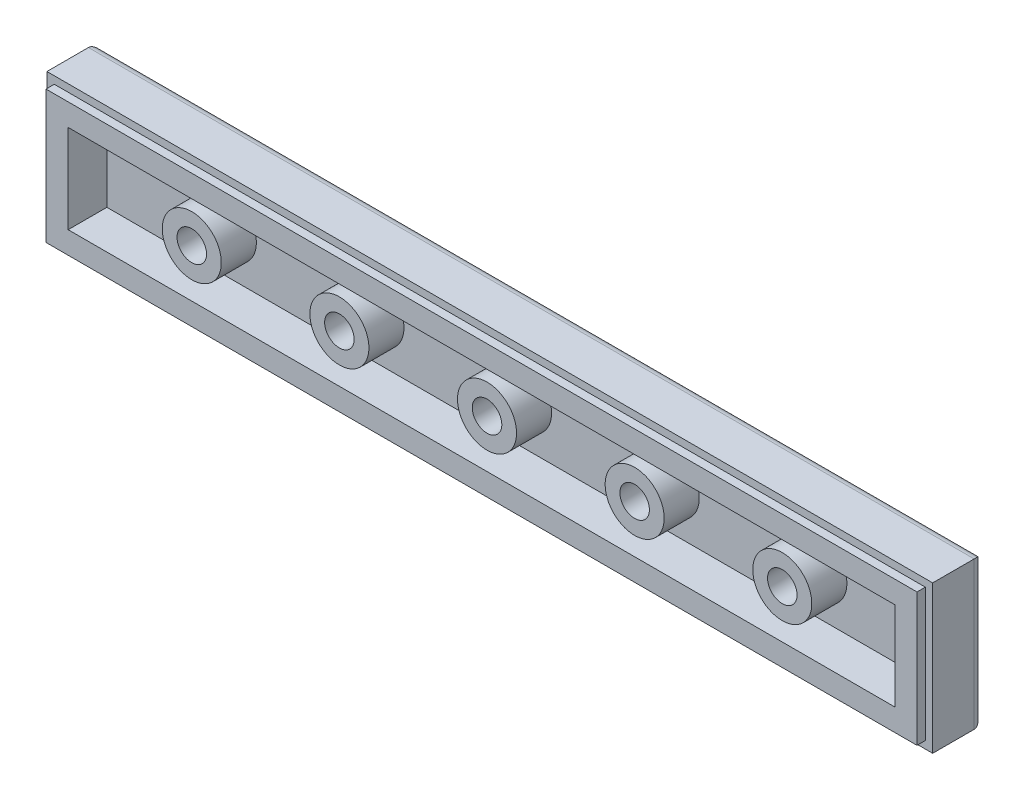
ISO-10303-21;
HEADER;
FILE_DESCRIPTION(('STEP AP214'),'2;1');
FILE_NAME('part.step','',(''),(''),'','','');
FILE_SCHEMA(('AUTOMOTIVE_DESIGN { 1 0 10303 214 1 1 1 1 }'));
ENDSEC;
DATA;
#1=APPLICATION_CONTEXT('core data for automotive mechanical design processes');
#2=APPLICATION_PROTOCOL_DEFINITION('international standard','automotive_design',2000,#1);
#3=PRODUCT_CONTEXT('',#1,'mechanical');
#4=PRODUCT('Part','Part','',(#3));
#5=PRODUCT_RELATED_PRODUCT_CATEGORY('part','',(#4));
#6=PRODUCT_DEFINITION_FORMATION('','',#4);
#7=PRODUCT_DEFINITION_CONTEXT('part definition',#1,'design');
#8=PRODUCT_DEFINITION('design','',#6,#7);
#9=PRODUCT_DEFINITION_SHAPE('','',#8);
#10=(LENGTH_UNIT() NAMED_UNIT(*) SI_UNIT(.MILLI.,.METRE.));
#11=(NAMED_UNIT(*) PLANE_ANGLE_UNIT() SI_UNIT($,.RADIAN.));
#12=(NAMED_UNIT(*) SI_UNIT($,.STERADIAN.) SOLID_ANGLE_UNIT());
#13=UNCERTAINTY_MEASURE_WITH_UNIT(LENGTH_MEASURE(1.E-05),#10,'distance_accuracy_value','');
#14=(GEOMETRIC_REPRESENTATION_CONTEXT(3) GLOBAL_UNCERTAINTY_ASSIGNED_CONTEXT((#13)) GLOBAL_UNIT_ASSIGNED_CONTEXT((#10,
#11,#12)) REPRESENTATION_CONTEXT('',''));
#15=CARTESIAN_POINT('',(0.,0.,0.));
#16=DIRECTION('',(0.,0.,1.));
#17=DIRECTION('',(1.,0.,0.));
#18=AXIS2_PLACEMENT_3D('',#15,#16,#17);
#19=CARTESIAN_POINT('',(0.,0.,3.2));
#20=DIRECTION('',(0.,0.,-1.));
#21=DIRECTION('',(-1.,0.,0.));
#22=AXIS2_PLACEMENT_3D('',#19,#20,#21);
#23=PLANE('',#22);
#24=DIRECTION('',(-1.,0.,0.));
#25=VECTOR('',#24,1.);
#26=CARTESIAN_POINT('',(-1.6,-1.6,3.2));
#27=LINE('',#26,#25);
#28=CARTESIAN_POINT('',(-1.6,-1.6,3.2));
#29=VERTEX_POINT('',#28);
#30=CARTESIAN_POINT('',(-46.4,-1.60000000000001,3.2));
#31=VERTEX_POINT('',#30);
#32=EDGE_CURVE('E223',#29,#31,#27,.T.);
#33=ORIENTED_EDGE('',*,*,#32,.F.);
#34=DIRECTION('',(0.,1.,0.));
#35=VECTOR('',#34,1.);
#36=CARTESIAN_POINT('',(-1.6,-6.40000000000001,3.2));
#37=LINE('',#36,#35);
#38=CARTESIAN_POINT('',(-1.6,-6.40000000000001,3.2));
#39=VERTEX_POINT('',#38);
#40=EDGE_CURVE('E221',#39,#29,#37,.T.);
#41=ORIENTED_EDGE('',*,*,#40,.F.);
#42=DIRECTION('',(1.,0.,0.));
#43=VECTOR('',#42,1.);
#44=CARTESIAN_POINT('',(-1.6,-6.40000000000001,3.2));
#45=LINE('',#44,#43);
#46=CARTESIAN_POINT('',(-46.4,-6.40000000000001,3.2));
#47=VERTEX_POINT('',#46);
#48=EDGE_CURVE('E229',#47,#39,#45,.T.);
#49=ORIENTED_EDGE('',*,*,#48,.F.);
#50=DIRECTION('',(0.,-1.,0.));
#51=VECTOR('',#50,1.);
#52=CARTESIAN_POINT('',(-46.4,-6.40000000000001,3.2));
#53=LINE('',#52,#51);
#54=EDGE_CURVE('E226',#31,#47,#53,.T.);
#55=ORIENTED_EDGE('',*,*,#54,.F.);
#56=EDGE_LOOP('',(#33,#41,#49,#55));
#57=FACE_BOUND('',#56,.T.);
#58=DIRECTION('',(0.,-1.,0.));
#59=VECTOR('',#58,1.);
#60=CARTESIAN_POINT('',(-47.6,-0.4,3.2));
#61=LINE('',#60,#59);
#62=CARTESIAN_POINT('',(-47.6,-0.4,3.2));
#63=VERTEX_POINT('',#62);
#64=CARTESIAN_POINT('',(-47.6,-7.6,3.2));
#65=VERTEX_POINT('',#64);
#66=EDGE_CURVE('E154',#63,#65,#61,.T.);
#67=ORIENTED_EDGE('',*,*,#66,.T.);
#68=DIRECTION('',(1.,0.,0.));
#69=VECTOR('',#68,1.);
#70=CARTESIAN_POINT('',(-47.6,-7.6,3.2));
#71=LINE('',#70,#69);
#72=CARTESIAN_POINT('',(-0.399999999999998,-7.6,3.2));
#73=VERTEX_POINT('',#72);
#74=EDGE_CURVE('E152',#65,#73,#71,.T.);
#75=ORIENTED_EDGE('',*,*,#74,.T.);
#76=DIRECTION('',(0.,1.,0.));
#77=VECTOR('',#76,1.);
#78=CARTESIAN_POINT('',(-0.399999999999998,-0.4,3.2));
#79=LINE('',#78,#77);
#80=CARTESIAN_POINT('',(-0.399999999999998,-0.4,3.2));
#81=VERTEX_POINT('',#80);
#82=EDGE_CURVE('E133',#73,#81,#79,.T.);
#83=ORIENTED_EDGE('',*,*,#82,.T.);
#84=DIRECTION('',(-1.,0.,0.));
#85=VECTOR('',#84,1.);
#86=CARTESIAN_POINT('',(-47.6,-0.4,3.2));
#87=LINE('',#86,#85);
#88=EDGE_CURVE('E143',#81,#63,#87,.T.);
#89=ORIENTED_EDGE('',*,*,#88,.T.);
#90=EDGE_LOOP('',(#67,#75,#83,#89));
#91=FACE_BOUND('',#90,.T.);
#92=ADVANCED_FACE('F27',(#57,#91),#23,.F.);
#93=CARTESIAN_POINT('',(-1.6,-6.40000000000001,1.1));
#94=DIRECTION('',(0.,0.,1.));
#95=DIRECTION('',(1.,0.,0.));
#96=AXIS2_PLACEMENT_3D('',#93,#94,#95);
#97=PLANE('',#96);
#98=DIRECTION('',(0.,1.,0.));
#99=VECTOR('',#98,1.);
#100=CARTESIAN_POINT('',(-1.6,-6.40000000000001,1.1));
#101=LINE('',#100,#99);
#102=CARTESIAN_POINT('',(-1.6,-6.40000000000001,1.1));
#103=VERTEX_POINT('',#102);
#104=CARTESIAN_POINT('',(-1.6,-1.6,1.1));
#105=VERTEX_POINT('',#104);
#106=EDGE_CURVE('E232',#103,#105,#101,.T.);
#107=ORIENTED_EDGE('',*,*,#106,.T.);
#108=DIRECTION('',(-1.,0.,0.));
#109=VECTOR('',#108,1.);
#110=CARTESIAN_POINT('',(-1.6,-1.6,1.1));
#111=LINE('',#110,#109);
#112=CARTESIAN_POINT('',(-46.4,-1.60000000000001,1.1));
#113=VERTEX_POINT('',#112);
#114=EDGE_CURVE('E235',#105,#113,#111,.T.);
#115=ORIENTED_EDGE('',*,*,#114,.T.);
#116=DIRECTION('',(0.,-1.,0.));
#117=VECTOR('',#116,1.);
#118=CARTESIAN_POINT('',(-46.4,-6.40000000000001,1.1));
#119=LINE('',#118,#117);
#120=CARTESIAN_POINT('',(-46.4,-6.40000000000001,1.1));
#121=VERTEX_POINT('',#120);
#122=EDGE_CURVE('E238',#113,#121,#119,.T.);
#123=ORIENTED_EDGE('',*,*,#122,.T.);
#124=DIRECTION('',(1.,0.,0.));
#125=VECTOR('',#124,1.);
#126=CARTESIAN_POINT('',(-1.6,-6.40000000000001,1.1));
#127=LINE('',#126,#125);
#128=EDGE_CURVE('E241',#121,#103,#127,.T.);
#129=ORIENTED_EDGE('',*,*,#128,.T.);
#130=EDGE_LOOP('',(#107,#115,#123,#129));
#131=FACE_BOUND('',#130,.T.);
#132=CARTESIAN_POINT('',(-7.9,-4.00000000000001,1.1));
#133=DIRECTION('',(0.,0.,1.));
#134=DIRECTION('',(1.,0.,0.));
#135=AXIS2_PLACEMENT_3D('',#132,#133,#134);
#136=CIRCLE('',#135,1.6);
#137=CARTESIAN_POINT('',(-9.5,-4.00000000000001,1.1));
#138=VERTEX_POINT('',#137);
#139=EDGE_CURVE('E215',#138,#138,#136,.T.);
#140=ORIENTED_EDGE('',*,*,#139,.F.);
#141=EDGE_LOOP('',(#140));
#142=FACE_BOUND('',#141,.T.);
#143=CARTESIAN_POINT('',(-15.9,-4.00000000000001,1.1));
#144=DIRECTION('',(0.,0.,1.));
#145=DIRECTION('',(1.,0.,0.));
#146=AXIS2_PLACEMENT_3D('',#143,#144,#145);
#147=CIRCLE('',#146,1.6);
#148=CARTESIAN_POINT('',(-17.5,-4.00000000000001,1.1));
#149=VERTEX_POINT('',#148);
#150=EDGE_CURVE('E206',#149,#149,#147,.T.);
#151=ORIENTED_EDGE('',*,*,#150,.F.);
#152=EDGE_LOOP('',(#151));
#153=FACE_BOUND('',#152,.T.);
#154=CARTESIAN_POINT('',(-23.9,-4.00000000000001,1.1));
#155=DIRECTION('',(0.,0.,1.));
#156=DIRECTION('',(1.,0.,0.));
#157=AXIS2_PLACEMENT_3D('',#154,#155,#156);
#158=CIRCLE('',#157,1.6);
#159=CARTESIAN_POINT('',(-25.5,-4.00000000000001,1.1));
#160=VERTEX_POINT('',#159);
#161=EDGE_CURVE('E197',#160,#160,#158,.T.);
#162=ORIENTED_EDGE('',*,*,#161,.F.);
#163=EDGE_LOOP('',(#162));
#164=FACE_BOUND('',#163,.T.);
#165=CARTESIAN_POINT('',(-31.9,-4.00000000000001,1.1));
#166=DIRECTION('',(0.,0.,1.));
#167=DIRECTION('',(1.,0.,0.));
#168=AXIS2_PLACEMENT_3D('',#165,#166,#167);
#169=CIRCLE('',#168,1.6);
#170=CARTESIAN_POINT('',(-33.5,-4.00000000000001,1.1));
#171=VERTEX_POINT('',#170);
#172=EDGE_CURVE('E188',#171,#171,#169,.T.);
#173=ORIENTED_EDGE('',*,*,#172,.F.);
#174=EDGE_LOOP('',(#173));
#175=FACE_BOUND('',#174,.T.);
#176=CARTESIAN_POINT('',(-39.9,-4.00000000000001,1.1));
#177=DIRECTION('',(0.,0.,1.));
#178=DIRECTION('',(1.,0.,0.));
#179=AXIS2_PLACEMENT_3D('',#176,#177,#178);
#180=CIRCLE('',#179,1.6);
#181=CARTESIAN_POINT('',(-41.5,-4.00000000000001,1.1));
#182=VERTEX_POINT('',#181);
#183=EDGE_CURVE('E179',#182,#182,#180,.T.);
#184=ORIENTED_EDGE('',*,*,#183,.F.);
#185=EDGE_LOOP('',(#184));
#186=FACE_BOUND('',#185,.T.);
#187=ADVANCED_FACE('F353',(#131,#142,#153,#164,#175,#186),#97,.T.);
#188=CARTESIAN_POINT('',(-1.6,-6.40000000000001,1.1));
#189=DIRECTION('',(1.,0.,0.));
#190=DIRECTION('',(0.,0.,-1.));
#191=AXIS2_PLACEMENT_3D('',#188,#189,#190);
#192=PLANE('',#191);
#193=ORIENTED_EDGE('',*,*,#40,.T.);
#194=DIRECTION('',(0.,0.,1.));
#195=VECTOR('',#194,1.);
#196=CARTESIAN_POINT('',(-1.6,-1.6,1.1));
#197=LINE('',#196,#195);
#198=EDGE_CURVE('E244',#105,#29,#197,.T.);
#199=ORIENTED_EDGE('',*,*,#198,.F.);
#200=ORIENTED_EDGE('',*,*,#106,.F.);
#201=DIRECTION('',(0.,0.,1.));
#202=VECTOR('',#201,1.);
#203=CARTESIAN_POINT('',(-1.6,-6.40000000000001,1.1));
#204=LINE('',#203,#202);
#205=EDGE_CURVE('E245',#103,#39,#204,.T.);
#206=ORIENTED_EDGE('',*,*,#205,.T.);
#207=EDGE_LOOP('',(#193,#199,#200,#206));
#208=FACE_BOUND('',#207,.T.);
#209=ADVANCED_FACE('F360',(#208),#192,.F.);
#210=CARTESIAN_POINT('',(-1.6,-6.40000000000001,1.1));
#211=DIRECTION('',(0.,-1.,0.));
#212=DIRECTION('',(1.,0.,0.));
#213=AXIS2_PLACEMENT_3D('',#210,#211,#212);
#214=PLANE('',#213);
#215=ORIENTED_EDGE('',*,*,#48,.T.);
#216=ORIENTED_EDGE('',*,*,#205,.F.);
#217=ORIENTED_EDGE('',*,*,#128,.F.);
#218=DIRECTION('',(0.,0.,1.));
#219=VECTOR('',#218,1.);
#220=CARTESIAN_POINT('',(-46.4,-6.40000000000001,1.1));
#221=LINE('',#220,#219);
#222=EDGE_CURVE('E248',#121,#47,#221,.T.);
#223=ORIENTED_EDGE('',*,*,#222,.T.);
#224=EDGE_LOOP('',(#215,#216,#217,#223));
#225=FACE_BOUND('',#224,.T.);
#226=ADVANCED_FACE('F611',(#225),#214,.F.);
#227=CARTESIAN_POINT('',(-46.4,-6.40000000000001,1.1));
#228=DIRECTION('',(-1.,0.,0.));
#229=DIRECTION('',(0.,0.,1.));
#230=AXIS2_PLACEMENT_3D('',#227,#228,#229);
#231=PLANE('',#230);
#232=ORIENTED_EDGE('',*,*,#54,.T.);
#233=ORIENTED_EDGE('',*,*,#222,.F.);
#234=ORIENTED_EDGE('',*,*,#122,.F.);
#235=DIRECTION('',(0.,0.,1.));
#236=VECTOR('',#235,1.);
#237=CARTESIAN_POINT('',(-46.4,-1.60000000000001,1.1));
#238=LINE('',#237,#236);
#239=EDGE_CURVE('E250',#113,#31,#238,.T.);
#240=ORIENTED_EDGE('',*,*,#239,.T.);
#241=EDGE_LOOP('',(#232,#233,#234,#240));
#242=FACE_BOUND('',#241,.T.);
#243=ADVANCED_FACE('F603',(#242),#231,.F.);
#244=CARTESIAN_POINT('',(-1.6,-1.6,1.1));
#245=DIRECTION('',(0.,1.,0.));
#246=DIRECTION('',(-1.,0.,0.));
#247=AXIS2_PLACEMENT_3D('',#244,#245,#246);
#248=PLANE('',#247);
#249=ORIENTED_EDGE('',*,*,#32,.T.);
#250=ORIENTED_EDGE('',*,*,#239,.F.);
#251=ORIENTED_EDGE('',*,*,#114,.F.);
#252=ORIENTED_EDGE('',*,*,#198,.T.);
#253=EDGE_LOOP('',(#249,#250,#251,#252));
#254=FACE_BOUND('',#253,.T.);
#255=ADVANCED_FACE('F585',(#254),#248,.F.);
#256=CARTESIAN_POINT('',(-7.9,-4.00000000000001,3.));
#257=DIRECTION('',(0.,0.,1.));
#258=DIRECTION('',(1.,0.,0.));
#259=AXIS2_PLACEMENT_3D('',#256,#257,#258);
#260=PLANE('',#259);
#261=CARTESIAN_POINT('',(-7.9,-4.00000000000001,3.));
#262=DIRECTION('',(0.,0.,1.));
#263=DIRECTION('',(1.,0.,0.));
#264=AXIS2_PLACEMENT_3D('',#261,#262,#263);
#265=CIRCLE('',#264,1.6);
#266=CARTESIAN_POINT('',(-9.5,-4.00000000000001,3.));
#267=VERTEX_POINT('',#266);
#268=EDGE_CURVE('E218',#267,#267,#265,.T.);
#269=ORIENTED_EDGE('',*,*,#268,.T.);
#270=EDGE_LOOP('',(#269));
#271=FACE_BOUND('',#270,.T.);
#272=CARTESIAN_POINT('',(-7.9,-4.00000000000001,3.));
#273=DIRECTION('',(0.,0.,1.));
#274=DIRECTION('',(1.,0.,0.));
#275=AXIS2_PLACEMENT_3D('',#272,#273,#274);
#276=CIRCLE('',#275,0.799999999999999);
#277=CARTESIAN_POINT('',(-8.7,-4.00000000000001,3.));
#278=VERTEX_POINT('',#277);
#279=EDGE_CURVE('E212',#278,#278,#276,.T.);
#280=ORIENTED_EDGE('',*,*,#279,.F.);
#281=EDGE_LOOP('',(#280));
#282=FACE_BOUND('',#281,.T.);
#283=ADVANCED_FACE('F577',(#271,#282),#260,.T.);
#284=CARTESIAN_POINT('',(-7.9,-4.00000000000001,3.));
#285=DIRECTION('',(0.,0.,-1.));
#286=DIRECTION('',(-1.,0.,0.));
#287=AXIS2_PLACEMENT_3D('',#284,#285,#286);
#288=CYLINDRICAL_SURFACE('',#287,1.6);
#289=CARTESIAN_POINT('',(-9.5,-4.00000000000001,3.));
#290=CARTESIAN_POINT('',(-9.5,-4.00000000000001,2.98020833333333));
#291=CARTESIAN_POINT('',(-9.5,-4.00000000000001,2.96041666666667));
#292=CARTESIAN_POINT('',(-9.5,-4.00000000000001,2.92083333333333));
#293=CARTESIAN_POINT('',(-9.5,-4.00000000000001,2.90104166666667));
#294=CARTESIAN_POINT('',(-9.5,-4.00000000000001,2.86145833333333));
#295=CARTESIAN_POINT('',(-9.5,-4.00000000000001,2.84166666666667));
#296=CARTESIAN_POINT('',(-9.5,-4.00000000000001,2.80208333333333));
#297=CARTESIAN_POINT('',(-9.5,-4.00000000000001,2.78229166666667));
#298=CARTESIAN_POINT('',(-9.5,-4.00000000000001,2.74270833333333));
#299=CARTESIAN_POINT('',(-9.5,-4.00000000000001,2.72291666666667));
#300=CARTESIAN_POINT('',(-9.5,-4.00000000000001,2.68333333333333));
#301=CARTESIAN_POINT('',(-9.5,-4.00000000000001,2.66354166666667));
#302=CARTESIAN_POINT('',(-9.5,-4.00000000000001,2.62395833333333));
#303=CARTESIAN_POINT('',(-9.5,-4.00000000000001,2.60416666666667));
#304=CARTESIAN_POINT('',(-9.5,-4.00000000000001,2.56458333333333));
#305=CARTESIAN_POINT('',(-9.5,-4.00000000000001,2.54479166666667));
#306=CARTESIAN_POINT('',(-9.5,-4.00000000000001,2.50520833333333));
#307=CARTESIAN_POINT('',(-9.5,-4.00000000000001,2.48541666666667));
#308=CARTESIAN_POINT('',(-9.5,-4.00000000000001,2.44583333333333));
#309=CARTESIAN_POINT('',(-9.5,-4.00000000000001,2.42604166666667));
#310=CARTESIAN_POINT('',(-9.5,-4.00000000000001,2.38645833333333));
#311=CARTESIAN_POINT('',(-9.5,-4.00000000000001,2.36666666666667));
#312=CARTESIAN_POINT('',(-9.5,-4.00000000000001,2.32708333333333));
#313=CARTESIAN_POINT('',(-9.5,-4.00000000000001,2.30729166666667));
#314=CARTESIAN_POINT('',(-9.5,-4.00000000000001,2.26770833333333));
#315=CARTESIAN_POINT('',(-9.5,-4.00000000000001,2.24791666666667));
#316=CARTESIAN_POINT('',(-9.5,-4.00000000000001,2.20833333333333));
#317=CARTESIAN_POINT('',(-9.5,-4.00000000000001,2.18854166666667));
#318=CARTESIAN_POINT('',(-9.5,-4.00000000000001,2.14895833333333));
#319=CARTESIAN_POINT('',(-9.5,-4.00000000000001,2.12916666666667));
#320=CARTESIAN_POINT('',(-9.5,-4.00000000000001,2.08958333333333));
#321=CARTESIAN_POINT('',(-9.5,-4.00000000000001,2.06979166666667));
#322=CARTESIAN_POINT('',(-9.5,-4.00000000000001,2.03020833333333));
#323=CARTESIAN_POINT('',(-9.5,-4.00000000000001,2.01041666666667));
#324=CARTESIAN_POINT('',(-9.5,-4.00000000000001,1.97083333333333));
#325=CARTESIAN_POINT('',(-9.5,-4.00000000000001,1.95104166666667));
#326=CARTESIAN_POINT('',(-9.5,-4.00000000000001,1.91145833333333));
#327=CARTESIAN_POINT('',(-9.5,-4.00000000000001,1.89166666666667));
#328=CARTESIAN_POINT('',(-9.5,-4.00000000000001,1.85208333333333));
#329=CARTESIAN_POINT('',(-9.5,-4.00000000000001,1.83229166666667));
#330=CARTESIAN_POINT('',(-9.5,-4.00000000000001,1.79270833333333));
#331=CARTESIAN_POINT('',(-9.5,-4.00000000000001,1.77291666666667));
#332=CARTESIAN_POINT('',(-9.5,-4.00000000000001,1.73333333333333));
#333=CARTESIAN_POINT('',(-9.5,-4.00000000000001,1.71354166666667));
#334=CARTESIAN_POINT('',(-9.5,-4.00000000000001,1.67395833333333));
#335=CARTESIAN_POINT('',(-9.5,-4.00000000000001,1.65416666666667));
#336=CARTESIAN_POINT('',(-9.5,-4.00000000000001,1.61458333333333));
#337=CARTESIAN_POINT('',(-9.5,-4.00000000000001,1.59479166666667));
#338=CARTESIAN_POINT('',(-9.5,-4.00000000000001,1.55520833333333));
#339=CARTESIAN_POINT('',(-9.5,-4.00000000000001,1.53541666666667));
#340=CARTESIAN_POINT('',(-9.5,-4.00000000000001,1.49583333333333));
#341=CARTESIAN_POINT('',(-9.5,-4.00000000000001,1.47604166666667));
#342=CARTESIAN_POINT('',(-9.5,-4.00000000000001,1.43645833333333));
#343=CARTESIAN_POINT('',(-9.5,-4.00000000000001,1.41666666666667));
#344=CARTESIAN_POINT('',(-9.5,-4.00000000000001,1.37708333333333));
#345=CARTESIAN_POINT('',(-9.5,-4.00000000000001,1.35729166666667));
#346=CARTESIAN_POINT('',(-9.5,-4.00000000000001,1.31770833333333));
#347=CARTESIAN_POINT('',(-9.5,-4.00000000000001,1.29791666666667));
#348=CARTESIAN_POINT('',(-9.5,-4.00000000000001,1.25833333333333));
#349=CARTESIAN_POINT('',(-9.5,-4.00000000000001,1.23854166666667));
#350=CARTESIAN_POINT('',(-9.5,-4.00000000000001,1.19895833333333));
#351=CARTESIAN_POINT('',(-9.5,-4.00000000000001,1.17916666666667));
#352=CARTESIAN_POINT('',(-9.5,-4.00000000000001,1.13958333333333));
#353=CARTESIAN_POINT('',(-9.5,-4.00000000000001,1.11979166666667));
#354=CARTESIAN_POINT('',(-9.5,-4.00000000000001,1.1));
#355=B_SPLINE_CURVE_WITH_KNOTS('',3,(#289,#290,#291,#292,#293,#294,#295,#296,#297,#298,#299,
#300,#301,#302,#303,#304,#305,#306,#307,#308,#309,#310,#311,#312,#313,#314,#315,#316,#317,#318,
#319,#320,#321,#322,#323,#324,#325,#326,#327,#328,#329,#330,#331,#332,#333,#334,#335,#336,#337,
#338,#339,#340,#341,#342,#343,#344,#345,#346,#347,#348,#349,#350,#351,#352,#353,#354),
.UNSPECIFIED.,.F.,.F.,(4,2,2,2,2,2,2,2,2,2,2,2,2,2,2,2,2,2,2,2,2,2,2,2,2,2,2,2,2,2,2,2,4),(0.,
0.0593750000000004,0.11875,0.178125,0.2375,0.296875,0.35625,0.415625,0.475,0.534375,0.59375,
0.653125,0.7125,0.771875,0.83125,0.890625,0.95,1.009375,1.06875,1.128125,1.1875,1.246875,
1.30625,1.365625,1.425,1.484375,1.54375,1.603125,1.6625,1.721875,1.78125,1.840625,1.9),.UNSPECIFIED.);
#356=EDGE_CURVE('BSEAM569',#267,#138,#355,.T.);
#357=ORIENTED_EDGE('',*,*,#268,.F.);
#358=ORIENTED_EDGE('',*,*,#139,.T.);
#359=ORIENTED_EDGE('',*,*,#356,.T.);
#360=ORIENTED_EDGE('',*,*,#356,.F.);
#361=EDGE_LOOP('',(#357,#359,#358,#360));
#362=FACE_BOUND('',#361,.T.);
#363=ADVANCED_FACE('F569',(#362),#288,.T.);
#364=CARTESIAN_POINT('',(-7.9,-4.00000000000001,3.));
#365=DIRECTION('',(0.,0.,-1.));
#366=DIRECTION('',(-1.,0.,0.));
#367=AXIS2_PLACEMENT_3D('',#364,#365,#366);
#368=CYLINDRICAL_SURFACE('',#367,0.799999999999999);
#369=CARTESIAN_POINT('',(-7.9,-4.00000000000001,1.1));
#370=DIRECTION('',(0.,0.,1.));
#371=DIRECTION('',(1.,0.,0.));
#372=AXIS2_PLACEMENT_3D('',#369,#370,#371);
#373=CIRCLE('',#372,0.799999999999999);
#374=CARTESIAN_POINT('',(-8.7,-4.00000000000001,1.1));
#375=VERTEX_POINT('',#374);
#376=EDGE_CURVE('E262',#375,#375,#373,.F.);
#377=CARTESIAN_POINT('',(-8.7,-4.00000000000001,3.));
#378=CARTESIAN_POINT('',(-8.7,-4.00000000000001,2.98020833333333));
#379=CARTESIAN_POINT('',(-8.7,-4.00000000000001,2.96041666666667));
#380=CARTESIAN_POINT('',(-8.7,-4.00000000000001,2.92083333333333));
#381=CARTESIAN_POINT('',(-8.7,-4.00000000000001,2.90104166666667));
#382=CARTESIAN_POINT('',(-8.7,-4.00000000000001,2.86145833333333));
#383=CARTESIAN_POINT('',(-8.7,-4.00000000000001,2.84166666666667));
#384=CARTESIAN_POINT('',(-8.7,-4.00000000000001,2.80208333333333));
#385=CARTESIAN_POINT('',(-8.7,-4.00000000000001,2.78229166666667));
#386=CARTESIAN_POINT('',(-8.7,-4.00000000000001,2.74270833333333));
#387=CARTESIAN_POINT('',(-8.7,-4.00000000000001,2.72291666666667));
#388=CARTESIAN_POINT('',(-8.7,-4.00000000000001,2.68333333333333));
#389=CARTESIAN_POINT('',(-8.7,-4.00000000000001,2.66354166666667));
#390=CARTESIAN_POINT('',(-8.7,-4.00000000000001,2.62395833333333));
#391=CARTESIAN_POINT('',(-8.7,-4.00000000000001,2.60416666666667));
#392=CARTESIAN_POINT('',(-8.7,-4.00000000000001,2.56458333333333));
#393=CARTESIAN_POINT('',(-8.7,-4.00000000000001,2.54479166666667));
#394=CARTESIAN_POINT('',(-8.7,-4.00000000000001,2.50520833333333));
#395=CARTESIAN_POINT('',(-8.7,-4.00000000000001,2.48541666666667));
#396=CARTESIAN_POINT('',(-8.7,-4.00000000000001,2.44583333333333));
#397=CARTESIAN_POINT('',(-8.7,-4.00000000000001,2.42604166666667));
#398=CARTESIAN_POINT('',(-8.7,-4.00000000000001,2.38645833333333));
#399=CARTESIAN_POINT('',(-8.7,-4.00000000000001,2.36666666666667));
#400=CARTESIAN_POINT('',(-8.7,-4.00000000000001,2.32708333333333));
#401=CARTESIAN_POINT('',(-8.7,-4.00000000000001,2.30729166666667));
#402=CARTESIAN_POINT('',(-8.7,-4.00000000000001,2.26770833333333));
#403=CARTESIAN_POINT('',(-8.7,-4.00000000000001,2.24791666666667));
#404=CARTESIAN_POINT('',(-8.7,-4.00000000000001,2.20833333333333));
#405=CARTESIAN_POINT('',(-8.7,-4.00000000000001,2.18854166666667));
#406=CARTESIAN_POINT('',(-8.7,-4.00000000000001,2.14895833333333));
#407=CARTESIAN_POINT('',(-8.7,-4.00000000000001,2.12916666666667));
#408=CARTESIAN_POINT('',(-8.7,-4.00000000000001,2.08958333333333));
#409=CARTESIAN_POINT('',(-8.7,-4.00000000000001,2.06979166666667));
#410=CARTESIAN_POINT('',(-8.7,-4.00000000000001,2.03020833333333));
#411=CARTESIAN_POINT('',(-8.7,-4.00000000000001,2.01041666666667));
#412=CARTESIAN_POINT('',(-8.7,-4.00000000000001,1.97083333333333));
#413=CARTESIAN_POINT('',(-8.7,-4.00000000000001,1.95104166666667));
#414=CARTESIAN_POINT('',(-8.7,-4.00000000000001,1.91145833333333));
#415=CARTESIAN_POINT('',(-8.7,-4.00000000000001,1.89166666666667));
#416=CARTESIAN_POINT('',(-8.7,-4.00000000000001,1.85208333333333));
#417=CARTESIAN_POINT('',(-8.7,-4.00000000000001,1.83229166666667));
#418=CARTESIAN_POINT('',(-8.7,-4.00000000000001,1.79270833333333));
#419=CARTESIAN_POINT('',(-8.7,-4.00000000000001,1.77291666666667));
#420=CARTESIAN_POINT('',(-8.7,-4.00000000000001,1.73333333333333));
#421=CARTESIAN_POINT('',(-8.7,-4.00000000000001,1.71354166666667));
#422=CARTESIAN_POINT('',(-8.7,-4.00000000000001,1.67395833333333));
#423=CARTESIAN_POINT('',(-8.7,-4.00000000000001,1.65416666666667));
#424=CARTESIAN_POINT('',(-8.7,-4.00000000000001,1.61458333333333));
#425=CARTESIAN_POINT('',(-8.7,-4.00000000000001,1.59479166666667));
#426=CARTESIAN_POINT('',(-8.7,-4.00000000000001,1.55520833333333));
#427=CARTESIAN_POINT('',(-8.7,-4.00000000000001,1.53541666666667));
#428=CARTESIAN_POINT('',(-8.7,-4.00000000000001,1.49583333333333));
#429=CARTESIAN_POINT('',(-8.7,-4.00000000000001,1.47604166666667));
#430=CARTESIAN_POINT('',(-8.7,-4.00000000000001,1.43645833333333));
#431=CARTESIAN_POINT('',(-8.7,-4.00000000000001,1.41666666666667));
#432=CARTESIAN_POINT('',(-8.7,-4.00000000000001,1.37708333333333));
#433=CARTESIAN_POINT('',(-8.7,-4.00000000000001,1.35729166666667));
#434=CARTESIAN_POINT('',(-8.7,-4.00000000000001,1.31770833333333));
#435=CARTESIAN_POINT('',(-8.7,-4.00000000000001,1.29791666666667));
#436=CARTESIAN_POINT('',(-8.7,-4.00000000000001,1.25833333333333));
#437=CARTESIAN_POINT('',(-8.7,-4.00000000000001,1.23854166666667));
#438=CARTESIAN_POINT('',(-8.7,-4.00000000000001,1.19895833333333));
#439=CARTESIAN_POINT('',(-8.7,-4.00000000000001,1.17916666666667));
#440=CARTESIAN_POINT('',(-8.7,-4.00000000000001,1.13958333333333));
#441=CARTESIAN_POINT('',(-8.7,-4.00000000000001,1.11979166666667));
#442=CARTESIAN_POINT('',(-8.7,-4.00000000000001,1.1));
#443=B_SPLINE_CURVE_WITH_KNOTS('',3,(#377,#378,#379,#380,#381,#382,#383,#384,#385,#386,#387,
#388,#389,#390,#391,#392,#393,#394,#395,#396,#397,#398,#399,#400,#401,#402,#403,#404,#405,#406,
#407,#408,#409,#410,#411,#412,#413,#414,#415,#416,#417,#418,#419,#420,#421,#422,#423,#424,#425,
#426,#427,#428,#429,#430,#431,#432,#433,#434,#435,#436,#437,#438,#439,#440,#441,#442),
.UNSPECIFIED.,.F.,.F.,(4,2,2,2,2,2,2,2,2,2,2,2,2,2,2,2,2,2,2,2,2,2,2,2,2,2,2,2,2,2,2,2,4),(0.,
0.0593750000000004,0.11875,0.178125,0.2375,0.296875,0.35625,0.415625,0.475,0.534375,0.59375,
0.653125,0.7125,0.771875,0.83125,0.890625,0.95,1.009375,1.06875,1.128125,1.1875,1.246875,
1.30625,1.365625,1.425,1.484375,1.54375,1.603125,1.6625,1.721875,1.78125,1.840625,1.9),.UNSPECIFIED.);
#444=EDGE_CURVE('BSEAM564',#278,#375,#443,.T.);
#445=ORIENTED_EDGE('',*,*,#279,.T.);
#446=ORIENTED_EDGE('',*,*,#376,.T.);
#447=ORIENTED_EDGE('',*,*,#444,.T.);
#448=ORIENTED_EDGE('',*,*,#444,.F.);
#449=EDGE_LOOP('',(#445,#447,#446,#448));
#450=FACE_BOUND('',#449,.T.);
#451=ADVANCED_FACE('F564',(#450),#368,.F.);
#452=ORIENTED_EDGE('',*,*,#376,.F.);
#453=EDGE_LOOP('',(#452));
#454=FACE_BOUND('',#453,.T.);
#455=ADVANCED_FACE('F363',(#454),#97,.T.);
#456=CARTESIAN_POINT('',(-15.9,-4.00000000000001,3.));
#457=DIRECTION('',(0.,0.,1.));
#458=DIRECTION('',(1.,0.,0.));
#459=AXIS2_PLACEMENT_3D('',#456,#457,#458);
#460=PLANE('',#459);
#461=CARTESIAN_POINT('',(-15.9,-4.00000000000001,3.));
#462=DIRECTION('',(0.,0.,1.));
#463=DIRECTION('',(1.,0.,0.));
#464=AXIS2_PLACEMENT_3D('',#461,#462,#463);
#465=CIRCLE('',#464,1.6);
#466=CARTESIAN_POINT('',(-17.5,-4.00000000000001,3.));
#467=VERTEX_POINT('',#466);
#468=EDGE_CURVE('E209',#467,#467,#465,.T.);
#469=ORIENTED_EDGE('',*,*,#468,.T.);
#470=EDGE_LOOP('',(#469));
#471=FACE_BOUND('',#470,.T.);
#472=CARTESIAN_POINT('',(-15.9,-4.00000000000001,3.));
#473=DIRECTION('',(0.,0.,1.));
#474=DIRECTION('',(1.,0.,0.));
#475=AXIS2_PLACEMENT_3D('',#472,#473,#474);
#476=CIRCLE('',#475,0.799999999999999);
#477=CARTESIAN_POINT('',(-16.7,-4.00000000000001,3.));
#478=VERTEX_POINT('',#477);
#479=EDGE_CURVE('E203',#478,#478,#476,.T.);
#480=ORIENTED_EDGE('',*,*,#479,.F.);
#481=EDGE_LOOP('',(#480));
#482=FACE_BOUND('',#481,.T.);
#483=ADVANCED_FACE('F533',(#471,#482),#460,.T.);
#484=CARTESIAN_POINT('',(-15.9,-4.00000000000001,3.));
#485=DIRECTION('',(0.,0.,-1.));
#486=DIRECTION('',(-1.,0.,0.));
#487=AXIS2_PLACEMENT_3D('',#484,#485,#486);
#488=CYLINDRICAL_SURFACE('',#487,1.6);
#489=CARTESIAN_POINT('',(-17.5,-4.00000000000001,3.));
#490=CARTESIAN_POINT('',(-17.5,-4.00000000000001,2.98020833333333));
#491=CARTESIAN_POINT('',(-17.5,-4.00000000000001,2.96041666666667));
#492=CARTESIAN_POINT('',(-17.5,-4.00000000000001,2.92083333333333));
#493=CARTESIAN_POINT('',(-17.5,-4.00000000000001,2.90104166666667));
#494=CARTESIAN_POINT('',(-17.5,-4.00000000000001,2.86145833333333));
#495=CARTESIAN_POINT('',(-17.5,-4.00000000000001,2.84166666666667));
#496=CARTESIAN_POINT('',(-17.5,-4.00000000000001,2.80208333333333));
#497=CARTESIAN_POINT('',(-17.5,-4.00000000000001,2.78229166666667));
#498=CARTESIAN_POINT('',(-17.5,-4.00000000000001,2.74270833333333));
#499=CARTESIAN_POINT('',(-17.5,-4.00000000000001,2.72291666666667));
#500=CARTESIAN_POINT('',(-17.5,-4.00000000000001,2.68333333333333));
#501=CARTESIAN_POINT('',(-17.5,-4.00000000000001,2.66354166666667));
#502=CARTESIAN_POINT('',(-17.5,-4.00000000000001,2.62395833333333));
#503=CARTESIAN_POINT('',(-17.5,-4.00000000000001,2.60416666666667));
#504=CARTESIAN_POINT('',(-17.5,-4.00000000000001,2.56458333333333));
#505=CARTESIAN_POINT('',(-17.5,-4.00000000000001,2.54479166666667));
#506=CARTESIAN_POINT('',(-17.5,-4.00000000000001,2.50520833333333));
#507=CARTESIAN_POINT('',(-17.5,-4.00000000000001,2.48541666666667));
#508=CARTESIAN_POINT('',(-17.5,-4.00000000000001,2.44583333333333));
#509=CARTESIAN_POINT('',(-17.5,-4.00000000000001,2.42604166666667));
#510=CARTESIAN_POINT('',(-17.5,-4.00000000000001,2.38645833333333));
#511=CARTESIAN_POINT('',(-17.5,-4.00000000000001,2.36666666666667));
#512=CARTESIAN_POINT('',(-17.5,-4.00000000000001,2.32708333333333));
#513=CARTESIAN_POINT('',(-17.5,-4.00000000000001,2.30729166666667));
#514=CARTESIAN_POINT('',(-17.5,-4.00000000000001,2.26770833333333));
#515=CARTESIAN_POINT('',(-17.5,-4.00000000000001,2.24791666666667));
#516=CARTESIAN_POINT('',(-17.5,-4.00000000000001,2.20833333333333));
#517=CARTESIAN_POINT('',(-17.5,-4.00000000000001,2.18854166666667));
#518=CARTESIAN_POINT('',(-17.5,-4.00000000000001,2.14895833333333));
#519=CARTESIAN_POINT('',(-17.5,-4.00000000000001,2.12916666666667));
#520=CARTESIAN_POINT('',(-17.5,-4.00000000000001,2.08958333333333));
#521=CARTESIAN_POINT('',(-17.5,-4.00000000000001,2.06979166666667));
#522=CARTESIAN_POINT('',(-17.5,-4.00000000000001,2.03020833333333));
#523=CARTESIAN_POINT('',(-17.5,-4.00000000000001,2.01041666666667));
#524=CARTESIAN_POINT('',(-17.5,-4.00000000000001,1.97083333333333));
#525=CARTESIAN_POINT('',(-17.5,-4.00000000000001,1.95104166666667));
#526=CARTESIAN_POINT('',(-17.5,-4.00000000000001,1.91145833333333));
#527=CARTESIAN_POINT('',(-17.5,-4.00000000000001,1.89166666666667));
#528=CARTESIAN_POINT('',(-17.5,-4.00000000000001,1.85208333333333));
#529=CARTESIAN_POINT('',(-17.5,-4.00000000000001,1.83229166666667));
#530=CARTESIAN_POINT('',(-17.5,-4.00000000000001,1.79270833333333));
#531=CARTESIAN_POINT('',(-17.5,-4.00000000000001,1.77291666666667));
#532=CARTESIAN_POINT('',(-17.5,-4.00000000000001,1.73333333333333));
#533=CARTESIAN_POINT('',(-17.5,-4.00000000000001,1.71354166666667));
#534=CARTESIAN_POINT('',(-17.5,-4.00000000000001,1.67395833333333));
#535=CARTESIAN_POINT('',(-17.5,-4.00000000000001,1.65416666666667));
#536=CARTESIAN_POINT('',(-17.5,-4.00000000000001,1.61458333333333));
#537=CARTESIAN_POINT('',(-17.5,-4.00000000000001,1.59479166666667));
#538=CARTESIAN_POINT('',(-17.5,-4.00000000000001,1.55520833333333));
#539=CARTESIAN_POINT('',(-17.5,-4.00000000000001,1.53541666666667));
#540=CARTESIAN_POINT('',(-17.5,-4.00000000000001,1.49583333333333));
#541=CARTESIAN_POINT('',(-17.5,-4.00000000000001,1.47604166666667));
#542=CARTESIAN_POINT('',(-17.5,-4.00000000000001,1.43645833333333));
#543=CARTESIAN_POINT('',(-17.5,-4.00000000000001,1.41666666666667));
#544=CARTESIAN_POINT('',(-17.5,-4.00000000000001,1.37708333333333));
#545=CARTESIAN_POINT('',(-17.5,-4.00000000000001,1.35729166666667));
#546=CARTESIAN_POINT('',(-17.5,-4.00000000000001,1.31770833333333));
#547=CARTESIAN_POINT('',(-17.5,-4.00000000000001,1.29791666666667));
#548=CARTESIAN_POINT('',(-17.5,-4.00000000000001,1.25833333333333));
#549=CARTESIAN_POINT('',(-17.5,-4.00000000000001,1.23854166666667));
#550=CARTESIAN_POINT('',(-17.5,-4.00000000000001,1.19895833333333));
#551=CARTESIAN_POINT('',(-17.5,-4.00000000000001,1.17916666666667));
#552=CARTESIAN_POINT('',(-17.5,-4.00000000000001,1.13958333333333));
#553=CARTESIAN_POINT('',(-17.5,-4.00000000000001,1.11979166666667));
#554=CARTESIAN_POINT('',(-17.5,-4.00000000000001,1.1));
#555=B_SPLINE_CURVE_WITH_KNOTS('',3,(#489,#490,#491,#492,#493,#494,#495,#496,#497,#498,#499,
#500,#501,#502,#503,#504,#505,#506,#507,#508,#509,#510,#511,#512,#513,#514,#515,#516,#517,#518,
#519,#520,#521,#522,#523,#524,#525,#526,#527,#528,#529,#530,#531,#532,#533,#534,#535,#536,#537,
#538,#539,#540,#541,#542,#543,#544,#545,#546,#547,#548,#549,#550,#551,#552,#553,#554),
.UNSPECIFIED.,.F.,.F.,(4,2,2,2,2,2,2,2,2,2,2,2,2,2,2,2,2,2,2,2,2,2,2,2,2,2,2,2,2,2,2,2,4),(0.,
0.0593750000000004,0.11875,0.178125,0.2375,0.296875,0.35625,0.415625,0.475,0.534375,0.59375,
0.653125,0.7125,0.771875,0.83125,0.890625,0.95,1.009375,1.06875,1.128125,1.1875,1.246875,
1.30625,1.365625,1.425,1.484375,1.54375,1.603125,1.6625,1.721875,1.78125,1.840625,1.9),.UNSPECIFIED.);
#556=EDGE_CURVE('BSEAM525',#467,#149,#555,.T.);
#557=ORIENTED_EDGE('',*,*,#468,.F.);
#558=ORIENTED_EDGE('',*,*,#150,.T.);
#559=ORIENTED_EDGE('',*,*,#556,.T.);
#560=ORIENTED_EDGE('',*,*,#556,.F.);
#561=EDGE_LOOP('',(#557,#559,#558,#560));
#562=FACE_BOUND('',#561,.T.);
#563=ADVANCED_FACE('F525',(#562),#488,.T.);
#564=CARTESIAN_POINT('',(-15.9,-4.00000000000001,3.));
#565=DIRECTION('',(0.,0.,-1.));
#566=DIRECTION('',(-1.,0.,0.));
#567=AXIS2_PLACEMENT_3D('',#564,#565,#566);
#568=CYLINDRICAL_SURFACE('',#567,0.799999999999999);
#569=CARTESIAN_POINT('',(-15.9,-4.00000000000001,1.1));
#570=DIRECTION('',(0.,0.,1.));
#571=DIRECTION('',(1.,0.,0.));
#572=AXIS2_PLACEMENT_3D('',#569,#570,#571);
#573=CIRCLE('',#572,0.799999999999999);
#574=CARTESIAN_POINT('',(-16.7,-4.00000000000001,1.1));
#575=VERTEX_POINT('',#574);
#576=EDGE_CURVE('E265',#575,#575,#573,.F.);
#577=CARTESIAN_POINT('',(-16.7,-4.00000000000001,3.));
#578=CARTESIAN_POINT('',(-16.7,-4.00000000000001,2.98020833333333));
#579=CARTESIAN_POINT('',(-16.7,-4.00000000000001,2.96041666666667));
#580=CARTESIAN_POINT('',(-16.7,-4.00000000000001,2.92083333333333));
#581=CARTESIAN_POINT('',(-16.7,-4.00000000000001,2.90104166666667));
#582=CARTESIAN_POINT('',(-16.7,-4.00000000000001,2.86145833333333));
#583=CARTESIAN_POINT('',(-16.7,-4.00000000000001,2.84166666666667));
#584=CARTESIAN_POINT('',(-16.7,-4.00000000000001,2.80208333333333));
#585=CARTESIAN_POINT('',(-16.7,-4.00000000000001,2.78229166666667));
#586=CARTESIAN_POINT('',(-16.7,-4.00000000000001,2.74270833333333));
#587=CARTESIAN_POINT('',(-16.7,-4.00000000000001,2.72291666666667));
#588=CARTESIAN_POINT('',(-16.7,-4.00000000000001,2.68333333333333));
#589=CARTESIAN_POINT('',(-16.7,-4.00000000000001,2.66354166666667));
#590=CARTESIAN_POINT('',(-16.7,-4.00000000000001,2.62395833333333));
#591=CARTESIAN_POINT('',(-16.7,-4.00000000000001,2.60416666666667));
#592=CARTESIAN_POINT('',(-16.7,-4.00000000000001,2.56458333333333));
#593=CARTESIAN_POINT('',(-16.7,-4.00000000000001,2.54479166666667));
#594=CARTESIAN_POINT('',(-16.7,-4.00000000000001,2.50520833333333));
#595=CARTESIAN_POINT('',(-16.7,-4.00000000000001,2.48541666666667));
#596=CARTESIAN_POINT('',(-16.7,-4.00000000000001,2.44583333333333));
#597=CARTESIAN_POINT('',(-16.7,-4.00000000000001,2.42604166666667));
#598=CARTESIAN_POINT('',(-16.7,-4.00000000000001,2.38645833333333));
#599=CARTESIAN_POINT('',(-16.7,-4.00000000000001,2.36666666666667));
#600=CARTESIAN_POINT('',(-16.7,-4.00000000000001,2.32708333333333));
#601=CARTESIAN_POINT('',(-16.7,-4.00000000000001,2.30729166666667));
#602=CARTESIAN_POINT('',(-16.7,-4.00000000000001,2.26770833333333));
#603=CARTESIAN_POINT('',(-16.7,-4.00000000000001,2.24791666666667));
#604=CARTESIAN_POINT('',(-16.7,-4.00000000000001,2.20833333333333));
#605=CARTESIAN_POINT('',(-16.7,-4.00000000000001,2.18854166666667));
#606=CARTESIAN_POINT('',(-16.7,-4.00000000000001,2.14895833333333));
#607=CARTESIAN_POINT('',(-16.7,-4.00000000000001,2.12916666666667));
#608=CARTESIAN_POINT('',(-16.7,-4.00000000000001,2.08958333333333));
#609=CARTESIAN_POINT('',(-16.7,-4.00000000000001,2.06979166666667));
#610=CARTESIAN_POINT('',(-16.7,-4.00000000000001,2.03020833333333));
#611=CARTESIAN_POINT('',(-16.7,-4.00000000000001,2.01041666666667));
#612=CARTESIAN_POINT('',(-16.7,-4.00000000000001,1.97083333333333));
#613=CARTESIAN_POINT('',(-16.7,-4.00000000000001,1.95104166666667));
#614=CARTESIAN_POINT('',(-16.7,-4.00000000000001,1.91145833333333));
#615=CARTESIAN_POINT('',(-16.7,-4.00000000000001,1.89166666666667));
#616=CARTESIAN_POINT('',(-16.7,-4.00000000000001,1.85208333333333));
#617=CARTESIAN_POINT('',(-16.7,-4.00000000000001,1.83229166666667));
#618=CARTESIAN_POINT('',(-16.7,-4.00000000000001,1.79270833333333));
#619=CARTESIAN_POINT('',(-16.7,-4.00000000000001,1.77291666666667));
#620=CARTESIAN_POINT('',(-16.7,-4.00000000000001,1.73333333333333));
#621=CARTESIAN_POINT('',(-16.7,-4.00000000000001,1.71354166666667));
#622=CARTESIAN_POINT('',(-16.7,-4.00000000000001,1.67395833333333));
#623=CARTESIAN_POINT('',(-16.7,-4.00000000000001,1.65416666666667));
#624=CARTESIAN_POINT('',(-16.7,-4.00000000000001,1.61458333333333));
#625=CARTESIAN_POINT('',(-16.7,-4.00000000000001,1.59479166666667));
#626=CARTESIAN_POINT('',(-16.7,-4.00000000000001,1.55520833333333));
#627=CARTESIAN_POINT('',(-16.7,-4.00000000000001,1.53541666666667));
#628=CARTESIAN_POINT('',(-16.7,-4.00000000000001,1.49583333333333));
#629=CARTESIAN_POINT('',(-16.7,-4.00000000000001,1.47604166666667));
#630=CARTESIAN_POINT('',(-16.7,-4.00000000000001,1.43645833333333));
#631=CARTESIAN_POINT('',(-16.7,-4.00000000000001,1.41666666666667));
#632=CARTESIAN_POINT('',(-16.7,-4.00000000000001,1.37708333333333));
#633=CARTESIAN_POINT('',(-16.7,-4.00000000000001,1.35729166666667));
#634=CARTESIAN_POINT('',(-16.7,-4.00000000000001,1.31770833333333));
#635=CARTESIAN_POINT('',(-16.7,-4.00000000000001,1.29791666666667));
#636=CARTESIAN_POINT('',(-16.7,-4.00000000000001,1.25833333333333));
#637=CARTESIAN_POINT('',(-16.7,-4.00000000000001,1.23854166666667));
#638=CARTESIAN_POINT('',(-16.7,-4.00000000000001,1.19895833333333));
#639=CARTESIAN_POINT('',(-16.7,-4.00000000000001,1.17916666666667));
#640=CARTESIAN_POINT('',(-16.7,-4.00000000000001,1.13958333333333));
#641=CARTESIAN_POINT('',(-16.7,-4.00000000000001,1.11979166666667));
#642=CARTESIAN_POINT('',(-16.7,-4.00000000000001,1.1));
#643=B_SPLINE_CURVE_WITH_KNOTS('',3,(#577,#578,#579,#580,#581,#582,#583,#584,#585,#586,#587,
#588,#589,#590,#591,#592,#593,#594,#595,#596,#597,#598,#599,#600,#601,#602,#603,#604,#605,#606,
#607,#608,#609,#610,#611,#612,#613,#614,#615,#616,#617,#618,#619,#620,#621,#622,#623,#624,#625,
#626,#627,#628,#629,#630,#631,#632,#633,#634,#635,#636,#637,#638,#639,#640,#641,#642),
.UNSPECIFIED.,.F.,.F.,(4,2,2,2,2,2,2,2,2,2,2,2,2,2,2,2,2,2,2,2,2,2,2,2,2,2,2,2,2,2,2,2,4),(0.,
0.0593750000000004,0.11875,0.178125,0.2375,0.296875,0.35625,0.415625,0.475,0.534375,0.59375,
0.653125,0.7125,0.771875,0.83125,0.890625,0.95,1.009375,1.06875,1.128125,1.1875,1.246875,
1.30625,1.365625,1.425,1.484375,1.54375,1.603125,1.6625,1.721875,1.78125,1.840625,1.9),.UNSPECIFIED.);
#644=EDGE_CURVE('BSEAM520',#478,#575,#643,.T.);
#645=ORIENTED_EDGE('',*,*,#479,.T.);
#646=ORIENTED_EDGE('',*,*,#576,.T.);
#647=ORIENTED_EDGE('',*,*,#644,.T.);
#648=ORIENTED_EDGE('',*,*,#644,.F.);
#649=EDGE_LOOP('',(#645,#647,#646,#648));
#650=FACE_BOUND('',#649,.T.);
#651=ADVANCED_FACE('F520',(#650),#568,.F.);
#652=ORIENTED_EDGE('',*,*,#576,.F.);
#653=EDGE_LOOP('',(#652));
#654=FACE_BOUND('',#653,.T.);
#655=ADVANCED_FACE('F515',(#654),#97,.T.);
#656=CARTESIAN_POINT('',(-23.9,-4.00000000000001,3.));
#657=DIRECTION('',(0.,0.,1.));
#658=DIRECTION('',(1.,0.,0.));
#659=AXIS2_PLACEMENT_3D('',#656,#657,#658);
#660=PLANE('',#659);
#661=CARTESIAN_POINT('',(-23.9,-4.00000000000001,3.));
#662=DIRECTION('',(0.,0.,1.));
#663=DIRECTION('',(1.,0.,0.));
#664=AXIS2_PLACEMENT_3D('',#661,#662,#663);
#665=CIRCLE('',#664,1.6);
#666=CARTESIAN_POINT('',(-25.5,-4.00000000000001,3.));
#667=VERTEX_POINT('',#666);
#668=EDGE_CURVE('E200',#667,#667,#665,.T.);
#669=ORIENTED_EDGE('',*,*,#668,.T.);
#670=EDGE_LOOP('',(#669));
#671=FACE_BOUND('',#670,.T.);
#672=CARTESIAN_POINT('',(-23.9,-4.00000000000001,3.));
#673=DIRECTION('',(0.,0.,1.));
#674=DIRECTION('',(1.,0.,0.));
#675=AXIS2_PLACEMENT_3D('',#672,#673,#674);
#676=CIRCLE('',#675,0.799999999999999);
#677=CARTESIAN_POINT('',(-24.7,-4.00000000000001,3.));
#678=VERTEX_POINT('',#677);
#679=EDGE_CURVE('E194',#678,#678,#676,.T.);
#680=ORIENTED_EDGE('',*,*,#679,.F.);
#681=EDGE_LOOP('',(#680));
#682=FACE_BOUND('',#681,.T.);
#683=ADVANCED_FACE('F507',(#671,#682),#660,.T.);
#684=CARTESIAN_POINT('',(-23.9,-4.00000000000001,3.));
#685=DIRECTION('',(0.,0.,-1.));
#686=DIRECTION('',(-1.,0.,0.));
#687=AXIS2_PLACEMENT_3D('',#684,#685,#686);
#688=CYLINDRICAL_SURFACE('',#687,1.6);
#689=CARTESIAN_POINT('',(-25.5,-4.00000000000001,3.));
#690=CARTESIAN_POINT('',(-25.5,-4.00000000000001,2.98020833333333));
#691=CARTESIAN_POINT('',(-25.5,-4.00000000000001,2.96041666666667));
#692=CARTESIAN_POINT('',(-25.5,-4.00000000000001,2.92083333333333));
#693=CARTESIAN_POINT('',(-25.5,-4.00000000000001,2.90104166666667));
#694=CARTESIAN_POINT('',(-25.5,-4.00000000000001,2.86145833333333));
#695=CARTESIAN_POINT('',(-25.5,-4.00000000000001,2.84166666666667));
#696=CARTESIAN_POINT('',(-25.5,-4.00000000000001,2.80208333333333));
#697=CARTESIAN_POINT('',(-25.5,-4.00000000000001,2.78229166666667));
#698=CARTESIAN_POINT('',(-25.5,-4.00000000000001,2.74270833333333));
#699=CARTESIAN_POINT('',(-25.5,-4.00000000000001,2.72291666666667));
#700=CARTESIAN_POINT('',(-25.5,-4.00000000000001,2.68333333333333));
#701=CARTESIAN_POINT('',(-25.5,-4.00000000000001,2.66354166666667));
#702=CARTESIAN_POINT('',(-25.5,-4.00000000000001,2.62395833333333));
#703=CARTESIAN_POINT('',(-25.5,-4.00000000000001,2.60416666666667));
#704=CARTESIAN_POINT('',(-25.5,-4.00000000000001,2.56458333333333));
#705=CARTESIAN_POINT('',(-25.5,-4.00000000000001,2.54479166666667));
#706=CARTESIAN_POINT('',(-25.5,-4.00000000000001,2.50520833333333));
#707=CARTESIAN_POINT('',(-25.5,-4.00000000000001,2.48541666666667));
#708=CARTESIAN_POINT('',(-25.5,-4.00000000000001,2.44583333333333));
#709=CARTESIAN_POINT('',(-25.5,-4.00000000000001,2.42604166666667));
#710=CARTESIAN_POINT('',(-25.5,-4.00000000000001,2.38645833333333));
#711=CARTESIAN_POINT('',(-25.5,-4.00000000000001,2.36666666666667));
#712=CARTESIAN_POINT('',(-25.5,-4.00000000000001,2.32708333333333));
#713=CARTESIAN_POINT('',(-25.5,-4.00000000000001,2.30729166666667));
#714=CARTESIAN_POINT('',(-25.5,-4.00000000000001,2.26770833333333));
#715=CARTESIAN_POINT('',(-25.5,-4.00000000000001,2.24791666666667));
#716=CARTESIAN_POINT('',(-25.5,-4.00000000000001,2.20833333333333));
#717=CARTESIAN_POINT('',(-25.5,-4.00000000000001,2.18854166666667));
#718=CARTESIAN_POINT('',(-25.5,-4.00000000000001,2.14895833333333));
#719=CARTESIAN_POINT('',(-25.5,-4.00000000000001,2.12916666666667));
#720=CARTESIAN_POINT('',(-25.5,-4.00000000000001,2.08958333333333));
#721=CARTESIAN_POINT('',(-25.5,-4.00000000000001,2.06979166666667));
#722=CARTESIAN_POINT('',(-25.5,-4.00000000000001,2.03020833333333));
#723=CARTESIAN_POINT('',(-25.5,-4.00000000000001,2.01041666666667));
#724=CARTESIAN_POINT('',(-25.5,-4.00000000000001,1.97083333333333));
#725=CARTESIAN_POINT('',(-25.5,-4.00000000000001,1.95104166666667));
#726=CARTESIAN_POINT('',(-25.5,-4.00000000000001,1.91145833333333));
#727=CARTESIAN_POINT('',(-25.5,-4.00000000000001,1.89166666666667));
#728=CARTESIAN_POINT('',(-25.5,-4.00000000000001,1.85208333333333));
#729=CARTESIAN_POINT('',(-25.5,-4.00000000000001,1.83229166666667));
#730=CARTESIAN_POINT('',(-25.5,-4.00000000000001,1.79270833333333));
#731=CARTESIAN_POINT('',(-25.5,-4.00000000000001,1.77291666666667));
#732=CARTESIAN_POINT('',(-25.5,-4.00000000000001,1.73333333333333));
#733=CARTESIAN_POINT('',(-25.5,-4.00000000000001,1.71354166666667));
#734=CARTESIAN_POINT('',(-25.5,-4.00000000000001,1.67395833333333));
#735=CARTESIAN_POINT('',(-25.5,-4.00000000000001,1.65416666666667));
#736=CARTESIAN_POINT('',(-25.5,-4.00000000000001,1.61458333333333));
#737=CARTESIAN_POINT('',(-25.5,-4.00000000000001,1.59479166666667));
#738=CARTESIAN_POINT('',(-25.5,-4.00000000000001,1.55520833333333));
#739=CARTESIAN_POINT('',(-25.5,-4.00000000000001,1.53541666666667));
#740=CARTESIAN_POINT('',(-25.5,-4.00000000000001,1.49583333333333));
#741=CARTESIAN_POINT('',(-25.5,-4.00000000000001,1.47604166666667));
#742=CARTESIAN_POINT('',(-25.5,-4.00000000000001,1.43645833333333));
#743=CARTESIAN_POINT('',(-25.5,-4.00000000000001,1.41666666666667));
#744=CARTESIAN_POINT('',(-25.5,-4.00000000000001,1.37708333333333));
#745=CARTESIAN_POINT('',(-25.5,-4.00000000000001,1.35729166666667));
#746=CARTESIAN_POINT('',(-25.5,-4.00000000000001,1.31770833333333));
#747=CARTESIAN_POINT('',(-25.5,-4.00000000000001,1.29791666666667));
#748=CARTESIAN_POINT('',(-25.5,-4.00000000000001,1.25833333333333));
#749=CARTESIAN_POINT('',(-25.5,-4.00000000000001,1.23854166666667));
#750=CARTESIAN_POINT('',(-25.5,-4.00000000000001,1.19895833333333));
#751=CARTESIAN_POINT('',(-25.5,-4.00000000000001,1.17916666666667));
#752=CARTESIAN_POINT('',(-25.5,-4.00000000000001,1.13958333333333));
#753=CARTESIAN_POINT('',(-25.5,-4.00000000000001,1.11979166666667));
#754=CARTESIAN_POINT('',(-25.5,-4.00000000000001,1.1));
#755=B_SPLINE_CURVE_WITH_KNOTS('',3,(#689,#690,#691,#692,#693,#694,#695,#696,#697,#698,#699,
#700,#701,#702,#703,#704,#705,#706,#707,#708,#709,#710,#711,#712,#713,#714,#715,#716,#717,#718,
#719,#720,#721,#722,#723,#724,#725,#726,#727,#728,#729,#730,#731,#732,#733,#734,#735,#736,#737,
#738,#739,#740,#741,#742,#743,#744,#745,#746,#747,#748,#749,#750,#751,#752,#753,#754),
.UNSPECIFIED.,.F.,.F.,(4,2,2,2,2,2,2,2,2,2,2,2,2,2,2,2,2,2,2,2,2,2,2,2,2,2,2,2,2,2,2,2,4),(0.,
0.0593750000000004,0.11875,0.178125,0.2375,0.296875,0.35625,0.415625,0.475,0.534375,0.59375,
0.653125,0.7125,0.771875,0.83125,0.890625,0.95,1.009375,1.06875,1.128125,1.1875,1.246875,
1.30625,1.365625,1.425,1.484375,1.54375,1.603125,1.6625,1.721875,1.78125,1.840625,1.9),.UNSPECIFIED.);
#756=EDGE_CURVE('BSEAM499',#667,#160,#755,.T.);
#757=ORIENTED_EDGE('',*,*,#668,.F.);
#758=ORIENTED_EDGE('',*,*,#161,.T.);
#759=ORIENTED_EDGE('',*,*,#756,.T.);
#760=ORIENTED_EDGE('',*,*,#756,.F.);
#761=EDGE_LOOP('',(#757,#759,#758,#760));
#762=FACE_BOUND('',#761,.T.);
#763=ADVANCED_FACE('F499',(#762),#688,.T.);
#764=CARTESIAN_POINT('',(-23.9,-4.00000000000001,3.));
#765=DIRECTION('',(0.,0.,-1.));
#766=DIRECTION('',(-1.,0.,0.));
#767=AXIS2_PLACEMENT_3D('',#764,#765,#766);
#768=CYLINDRICAL_SURFACE('',#767,0.799999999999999);
#769=CARTESIAN_POINT('',(-23.9,-4.00000000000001,1.1));
#770=DIRECTION('',(0.,0.,1.));
#771=DIRECTION('',(1.,0.,0.));
#772=AXIS2_PLACEMENT_3D('',#769,#770,#771);
#773=CIRCLE('',#772,0.799999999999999);
#774=CARTESIAN_POINT('',(-24.7,-4.00000000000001,1.1));
#775=VERTEX_POINT('',#774);
#776=EDGE_CURVE('E268',#775,#775,#773,.F.);
#777=CARTESIAN_POINT('',(-24.7,-4.00000000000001,3.));
#778=CARTESIAN_POINT('',(-24.7,-4.00000000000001,2.98020833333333));
#779=CARTESIAN_POINT('',(-24.7,-4.00000000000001,2.96041666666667));
#780=CARTESIAN_POINT('',(-24.7,-4.00000000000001,2.92083333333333));
#781=CARTESIAN_POINT('',(-24.7,-4.00000000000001,2.90104166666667));
#782=CARTESIAN_POINT('',(-24.7,-4.00000000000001,2.86145833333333));
#783=CARTESIAN_POINT('',(-24.7,-4.00000000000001,2.84166666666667));
#784=CARTESIAN_POINT('',(-24.7,-4.00000000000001,2.80208333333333));
#785=CARTESIAN_POINT('',(-24.7,-4.00000000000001,2.78229166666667));
#786=CARTESIAN_POINT('',(-24.7,-4.00000000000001,2.74270833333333));
#787=CARTESIAN_POINT('',(-24.7,-4.00000000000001,2.72291666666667));
#788=CARTESIAN_POINT('',(-24.7,-4.00000000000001,2.68333333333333));
#789=CARTESIAN_POINT('',(-24.7,-4.00000000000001,2.66354166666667));
#790=CARTESIAN_POINT('',(-24.7,-4.00000000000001,2.62395833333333));
#791=CARTESIAN_POINT('',(-24.7,-4.00000000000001,2.60416666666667));
#792=CARTESIAN_POINT('',(-24.7,-4.00000000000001,2.56458333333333));
#793=CARTESIAN_POINT('',(-24.7,-4.00000000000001,2.54479166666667));
#794=CARTESIAN_POINT('',(-24.7,-4.00000000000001,2.50520833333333));
#795=CARTESIAN_POINT('',(-24.7,-4.00000000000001,2.48541666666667));
#796=CARTESIAN_POINT('',(-24.7,-4.00000000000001,2.44583333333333));
#797=CARTESIAN_POINT('',(-24.7,-4.00000000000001,2.42604166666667));
#798=CARTESIAN_POINT('',(-24.7,-4.00000000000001,2.38645833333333));
#799=CARTESIAN_POINT('',(-24.7,-4.00000000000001,2.36666666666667));
#800=CARTESIAN_POINT('',(-24.7,-4.00000000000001,2.32708333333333));
#801=CARTESIAN_POINT('',(-24.7,-4.00000000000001,2.30729166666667));
#802=CARTESIAN_POINT('',(-24.7,-4.00000000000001,2.26770833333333));
#803=CARTESIAN_POINT('',(-24.7,-4.00000000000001,2.24791666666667));
#804=CARTESIAN_POINT('',(-24.7,-4.00000000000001,2.20833333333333));
#805=CARTESIAN_POINT('',(-24.7,-4.00000000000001,2.18854166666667));
#806=CARTESIAN_POINT('',(-24.7,-4.00000000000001,2.14895833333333));
#807=CARTESIAN_POINT('',(-24.7,-4.00000000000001,2.12916666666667));
#808=CARTESIAN_POINT('',(-24.7,-4.00000000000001,2.08958333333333));
#809=CARTESIAN_POINT('',(-24.7,-4.00000000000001,2.06979166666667));
#810=CARTESIAN_POINT('',(-24.7,-4.00000000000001,2.03020833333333));
#811=CARTESIAN_POINT('',(-24.7,-4.00000000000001,2.01041666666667));
#812=CARTESIAN_POINT('',(-24.7,-4.00000000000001,1.97083333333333));
#813=CARTESIAN_POINT('',(-24.7,-4.00000000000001,1.95104166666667));
#814=CARTESIAN_POINT('',(-24.7,-4.00000000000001,1.91145833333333));
#815=CARTESIAN_POINT('',(-24.7,-4.00000000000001,1.89166666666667));
#816=CARTESIAN_POINT('',(-24.7,-4.00000000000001,1.85208333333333));
#817=CARTESIAN_POINT('',(-24.7,-4.00000000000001,1.83229166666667));
#818=CARTESIAN_POINT('',(-24.7,-4.00000000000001,1.79270833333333));
#819=CARTESIAN_POINT('',(-24.7,-4.00000000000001,1.77291666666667));
#820=CARTESIAN_POINT('',(-24.7,-4.00000000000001,1.73333333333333));
#821=CARTESIAN_POINT('',(-24.7,-4.00000000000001,1.71354166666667));
#822=CARTESIAN_POINT('',(-24.7,-4.00000000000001,1.67395833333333));
#823=CARTESIAN_POINT('',(-24.7,-4.00000000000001,1.65416666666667));
#824=CARTESIAN_POINT('',(-24.7,-4.00000000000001,1.61458333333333));
#825=CARTESIAN_POINT('',(-24.7,-4.00000000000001,1.59479166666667));
#826=CARTESIAN_POINT('',(-24.7,-4.00000000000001,1.55520833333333));
#827=CARTESIAN_POINT('',(-24.7,-4.00000000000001,1.53541666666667));
#828=CARTESIAN_POINT('',(-24.7,-4.00000000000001,1.49583333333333));
#829=CARTESIAN_POINT('',(-24.7,-4.00000000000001,1.47604166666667));
#830=CARTESIAN_POINT('',(-24.7,-4.00000000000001,1.43645833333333));
#831=CARTESIAN_POINT('',(-24.7,-4.00000000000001,1.41666666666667));
#832=CARTESIAN_POINT('',(-24.7,-4.00000000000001,1.37708333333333));
#833=CARTESIAN_POINT('',(-24.7,-4.00000000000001,1.35729166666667));
#834=CARTESIAN_POINT('',(-24.7,-4.00000000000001,1.31770833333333));
#835=CARTESIAN_POINT('',(-24.7,-4.00000000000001,1.29791666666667));
#836=CARTESIAN_POINT('',(-24.7,-4.00000000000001,1.25833333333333));
#837=CARTESIAN_POINT('',(-24.7,-4.00000000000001,1.23854166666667));
#838=CARTESIAN_POINT('',(-24.7,-4.00000000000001,1.19895833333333));
#839=CARTESIAN_POINT('',(-24.7,-4.00000000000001,1.17916666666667));
#840=CARTESIAN_POINT('',(-24.7,-4.00000000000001,1.13958333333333));
#841=CARTESIAN_POINT('',(-24.7,-4.00000000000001,1.11979166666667));
#842=CARTESIAN_POINT('',(-24.7,-4.00000000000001,1.1));
#843=B_SPLINE_CURVE_WITH_KNOTS('',3,(#777,#778,#779,#780,#781,#782,#783,#784,#785,#786,#787,
#788,#789,#790,#791,#792,#793,#794,#795,#796,#797,#798,#799,#800,#801,#802,#803,#804,#805,#806,
#807,#808,#809,#810,#811,#812,#813,#814,#815,#816,#817,#818,#819,#820,#821,#822,#823,#824,#825,
#826,#827,#828,#829,#830,#831,#832,#833,#834,#835,#836,#837,#838,#839,#840,#841,#842),
.UNSPECIFIED.,.F.,.F.,(4,2,2,2,2,2,2,2,2,2,2,2,2,2,2,2,2,2,2,2,2,2,2,2,2,2,2,2,2,2,2,2,4),(0.,
0.0593750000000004,0.11875,0.178125,0.2375,0.296875,0.35625,0.415625,0.475,0.534375,0.59375,
0.653125,0.7125,0.771875,0.83125,0.890625,0.95,1.009375,1.06875,1.128125,1.1875,1.246875,
1.30625,1.365625,1.425,1.484375,1.54375,1.603125,1.6625,1.721875,1.78125,1.840625,1.9),.UNSPECIFIED.);
#844=EDGE_CURVE('BSEAM494',#678,#775,#843,.T.);
#845=ORIENTED_EDGE('',*,*,#679,.T.);
#846=ORIENTED_EDGE('',*,*,#776,.T.);
#847=ORIENTED_EDGE('',*,*,#844,.T.);
#848=ORIENTED_EDGE('',*,*,#844,.F.);
#849=EDGE_LOOP('',(#845,#847,#846,#848));
#850=FACE_BOUND('',#849,.T.);
#851=ADVANCED_FACE('F494',(#850),#768,.F.);
#852=ORIENTED_EDGE('',*,*,#776,.F.);
#853=EDGE_LOOP('',(#852));
#854=FACE_BOUND('',#853,.T.);
#855=ADVANCED_FACE('F489',(#854),#97,.T.);
#856=CARTESIAN_POINT('',(-31.9,-4.00000000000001,3.));
#857=DIRECTION('',(0.,0.,1.));
#858=DIRECTION('',(1.,0.,0.));
#859=AXIS2_PLACEMENT_3D('',#856,#857,#858);
#860=PLANE('',#859);
#861=CARTESIAN_POINT('',(-31.9,-4.00000000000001,3.));
#862=DIRECTION('',(0.,0.,1.));
#863=DIRECTION('',(1.,0.,0.));
#864=AXIS2_PLACEMENT_3D('',#861,#862,#863);
#865=CIRCLE('',#864,1.6);
#866=CARTESIAN_POINT('',(-33.5,-4.00000000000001,3.));
#867=VERTEX_POINT('',#866);
#868=EDGE_CURVE('E191',#867,#867,#865,.T.);
#869=ORIENTED_EDGE('',*,*,#868,.T.);
#870=EDGE_LOOP('',(#869));
#871=FACE_BOUND('',#870,.T.);
#872=CARTESIAN_POINT('',(-31.9,-4.00000000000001,3.));
#873=DIRECTION('',(0.,0.,1.));
#874=DIRECTION('',(1.,0.,0.));
#875=AXIS2_PLACEMENT_3D('',#872,#873,#874);
#876=CIRCLE('',#875,0.799999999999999);
#877=CARTESIAN_POINT('',(-32.7,-4.00000000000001,3.));
#878=VERTEX_POINT('',#877);
#879=EDGE_CURVE('E185',#878,#878,#876,.T.);
#880=ORIENTED_EDGE('',*,*,#879,.F.);
#881=EDGE_LOOP('',(#880));
#882=FACE_BOUND('',#881,.T.);
#883=ADVANCED_FACE('F481',(#871,#882),#860,.T.);
#884=CARTESIAN_POINT('',(-31.9,-4.00000000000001,3.));
#885=DIRECTION('',(0.,0.,-1.));
#886=DIRECTION('',(-1.,0.,0.));
#887=AXIS2_PLACEMENT_3D('',#884,#885,#886);
#888=CYLINDRICAL_SURFACE('',#887,1.6);
#889=CARTESIAN_POINT('',(-33.5,-4.00000000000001,3.));
#890=CARTESIAN_POINT('',(-33.5,-4.00000000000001,2.98020833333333));
#891=CARTESIAN_POINT('',(-33.5,-4.00000000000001,2.96041666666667));
#892=CARTESIAN_POINT('',(-33.5,-4.00000000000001,2.92083333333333));
#893=CARTESIAN_POINT('',(-33.5,-4.00000000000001,2.90104166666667));
#894=CARTESIAN_POINT('',(-33.5,-4.00000000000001,2.86145833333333));
#895=CARTESIAN_POINT('',(-33.5,-4.00000000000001,2.84166666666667));
#896=CARTESIAN_POINT('',(-33.5,-4.00000000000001,2.80208333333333));
#897=CARTESIAN_POINT('',(-33.5,-4.00000000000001,2.78229166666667));
#898=CARTESIAN_POINT('',(-33.5,-4.00000000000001,2.74270833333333));
#899=CARTESIAN_POINT('',(-33.5,-4.00000000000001,2.72291666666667));
#900=CARTESIAN_POINT('',(-33.5,-4.00000000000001,2.68333333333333));
#901=CARTESIAN_POINT('',(-33.5,-4.00000000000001,2.66354166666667));
#902=CARTESIAN_POINT('',(-33.5,-4.00000000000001,2.62395833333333));
#903=CARTESIAN_POINT('',(-33.5,-4.00000000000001,2.60416666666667));
#904=CARTESIAN_POINT('',(-33.5,-4.00000000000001,2.56458333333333));
#905=CARTESIAN_POINT('',(-33.5,-4.00000000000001,2.54479166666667));
#906=CARTESIAN_POINT('',(-33.5,-4.00000000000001,2.50520833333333));
#907=CARTESIAN_POINT('',(-33.5,-4.00000000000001,2.48541666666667));
#908=CARTESIAN_POINT('',(-33.5,-4.00000000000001,2.44583333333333));
#909=CARTESIAN_POINT('',(-33.5,-4.00000000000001,2.42604166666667));
#910=CARTESIAN_POINT('',(-33.5,-4.00000000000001,2.38645833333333));
#911=CARTESIAN_POINT('',(-33.5,-4.00000000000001,2.36666666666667));
#912=CARTESIAN_POINT('',(-33.5,-4.00000000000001,2.32708333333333));
#913=CARTESIAN_POINT('',(-33.5,-4.00000000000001,2.30729166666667));
#914=CARTESIAN_POINT('',(-33.5,-4.00000000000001,2.26770833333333));
#915=CARTESIAN_POINT('',(-33.5,-4.00000000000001,2.24791666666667));
#916=CARTESIAN_POINT('',(-33.5,-4.00000000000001,2.20833333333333));
#917=CARTESIAN_POINT('',(-33.5,-4.00000000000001,2.18854166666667));
#918=CARTESIAN_POINT('',(-33.5,-4.00000000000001,2.14895833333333));
#919=CARTESIAN_POINT('',(-33.5,-4.00000000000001,2.12916666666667));
#920=CARTESIAN_POINT('',(-33.5,-4.00000000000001,2.08958333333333));
#921=CARTESIAN_POINT('',(-33.5,-4.00000000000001,2.06979166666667));
#922=CARTESIAN_POINT('',(-33.5,-4.00000000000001,2.03020833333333));
#923=CARTESIAN_POINT('',(-33.5,-4.00000000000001,2.01041666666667));
#924=CARTESIAN_POINT('',(-33.5,-4.00000000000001,1.97083333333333));
#925=CARTESIAN_POINT('',(-33.5,-4.00000000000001,1.95104166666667));
#926=CARTESIAN_POINT('',(-33.5,-4.00000000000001,1.91145833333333));
#927=CARTESIAN_POINT('',(-33.5,-4.00000000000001,1.89166666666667));
#928=CARTESIAN_POINT('',(-33.5,-4.00000000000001,1.85208333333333));
#929=CARTESIAN_POINT('',(-33.5,-4.00000000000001,1.83229166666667));
#930=CARTESIAN_POINT('',(-33.5,-4.00000000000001,1.79270833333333));
#931=CARTESIAN_POINT('',(-33.5,-4.00000000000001,1.77291666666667));
#932=CARTESIAN_POINT('',(-33.5,-4.00000000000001,1.73333333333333));
#933=CARTESIAN_POINT('',(-33.5,-4.00000000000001,1.71354166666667));
#934=CARTESIAN_POINT('',(-33.5,-4.00000000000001,1.67395833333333));
#935=CARTESIAN_POINT('',(-33.5,-4.00000000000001,1.65416666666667));
#936=CARTESIAN_POINT('',(-33.5,-4.00000000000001,1.61458333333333));
#937=CARTESIAN_POINT('',(-33.5,-4.00000000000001,1.59479166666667));
#938=CARTESIAN_POINT('',(-33.5,-4.00000000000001,1.55520833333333));
#939=CARTESIAN_POINT('',(-33.5,-4.00000000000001,1.53541666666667));
#940=CARTESIAN_POINT('',(-33.5,-4.00000000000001,1.49583333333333));
#941=CARTESIAN_POINT('',(-33.5,-4.00000000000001,1.47604166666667));
#942=CARTESIAN_POINT('',(-33.5,-4.00000000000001,1.43645833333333));
#943=CARTESIAN_POINT('',(-33.5,-4.00000000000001,1.41666666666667));
#944=CARTESIAN_POINT('',(-33.5,-4.00000000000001,1.37708333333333));
#945=CARTESIAN_POINT('',(-33.5,-4.00000000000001,1.35729166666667));
#946=CARTESIAN_POINT('',(-33.5,-4.00000000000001,1.31770833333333));
#947=CARTESIAN_POINT('',(-33.5,-4.00000000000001,1.29791666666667));
#948=CARTESIAN_POINT('',(-33.5,-4.00000000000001,1.25833333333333));
#949=CARTESIAN_POINT('',(-33.5,-4.00000000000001,1.23854166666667));
#950=CARTESIAN_POINT('',(-33.5,-4.00000000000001,1.19895833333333));
#951=CARTESIAN_POINT('',(-33.5,-4.00000000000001,1.17916666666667));
#952=CARTESIAN_POINT('',(-33.5,-4.00000000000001,1.13958333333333));
#953=CARTESIAN_POINT('',(-33.5,-4.00000000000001,1.11979166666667));
#954=CARTESIAN_POINT('',(-33.5,-4.00000000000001,1.1));
#955=B_SPLINE_CURVE_WITH_KNOTS('',3,(#889,#890,#891,#892,#893,#894,#895,#896,#897,#898,#899,
#900,#901,#902,#903,#904,#905,#906,#907,#908,#909,#910,#911,#912,#913,#914,#915,#916,#917,#918,
#919,#920,#921,#922,#923,#924,#925,#926,#927,#928,#929,#930,#931,#932,#933,#934,#935,#936,#937,
#938,#939,#940,#941,#942,#943,#944,#945,#946,#947,#948,#949,#950,#951,#952,#953,#954),
.UNSPECIFIED.,.F.,.F.,(4,2,2,2,2,2,2,2,2,2,2,2,2,2,2,2,2,2,2,2,2,2,2,2,2,2,2,2,2,2,2,2,4),(0.,
0.0593750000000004,0.11875,0.178125,0.2375,0.296875,0.35625,0.415625,0.475,0.534375,0.59375,
0.653125,0.7125,0.771875,0.83125,0.890625,0.95,1.009375,1.06875,1.128125,1.1875,1.246875,
1.30625,1.365625,1.425,1.484375,1.54375,1.603125,1.6625,1.721875,1.78125,1.840625,1.9),.UNSPECIFIED.);
#956=EDGE_CURVE('BSEAM473',#867,#171,#955,.T.);
#957=ORIENTED_EDGE('',*,*,#868,.F.);
#958=ORIENTED_EDGE('',*,*,#172,.T.);
#959=ORIENTED_EDGE('',*,*,#956,.T.);
#960=ORIENTED_EDGE('',*,*,#956,.F.);
#961=EDGE_LOOP('',(#957,#959,#958,#960));
#962=FACE_BOUND('',#961,.T.);
#963=ADVANCED_FACE('F473',(#962),#888,.T.);
#964=CARTESIAN_POINT('',(-31.9,-4.00000000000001,3.));
#965=DIRECTION('',(0.,0.,-1.));
#966=DIRECTION('',(-1.,0.,0.));
#967=AXIS2_PLACEMENT_3D('',#964,#965,#966);
#968=CYLINDRICAL_SURFACE('',#967,0.799999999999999);
#969=CARTESIAN_POINT('',(-31.9,-4.00000000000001,1.1));
#970=DIRECTION('',(0.,0.,1.));
#971=DIRECTION('',(1.,0.,0.));
#972=AXIS2_PLACEMENT_3D('',#969,#970,#971);
#973=CIRCLE('',#972,0.799999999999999);
#974=CARTESIAN_POINT('',(-32.7,-4.00000000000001,1.1));
#975=VERTEX_POINT('',#974);
#976=EDGE_CURVE('E271',#975,#975,#973,.F.);
#977=CARTESIAN_POINT('',(-32.7,-4.00000000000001,3.));
#978=CARTESIAN_POINT('',(-32.7,-4.00000000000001,2.98020833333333));
#979=CARTESIAN_POINT('',(-32.7,-4.00000000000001,2.96041666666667));
#980=CARTESIAN_POINT('',(-32.7,-4.00000000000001,2.92083333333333));
#981=CARTESIAN_POINT('',(-32.7,-4.00000000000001,2.90104166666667));
#982=CARTESIAN_POINT('',(-32.7,-4.00000000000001,2.86145833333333));
#983=CARTESIAN_POINT('',(-32.7,-4.00000000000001,2.84166666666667));
#984=CARTESIAN_POINT('',(-32.7,-4.00000000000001,2.80208333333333));
#985=CARTESIAN_POINT('',(-32.7,-4.00000000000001,2.78229166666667));
#986=CARTESIAN_POINT('',(-32.7,-4.00000000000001,2.74270833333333));
#987=CARTESIAN_POINT('',(-32.7,-4.00000000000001,2.72291666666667));
#988=CARTESIAN_POINT('',(-32.7,-4.00000000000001,2.68333333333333));
#989=CARTESIAN_POINT('',(-32.7,-4.00000000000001,2.66354166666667));
#990=CARTESIAN_POINT('',(-32.7,-4.00000000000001,2.62395833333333));
#991=CARTESIAN_POINT('',(-32.7,-4.00000000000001,2.60416666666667));
#992=CARTESIAN_POINT('',(-32.7,-4.00000000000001,2.56458333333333));
#993=CARTESIAN_POINT('',(-32.7,-4.00000000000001,2.54479166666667));
#994=CARTESIAN_POINT('',(-32.7,-4.00000000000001,2.50520833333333));
#995=CARTESIAN_POINT('',(-32.7,-4.00000000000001,2.48541666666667));
#996=CARTESIAN_POINT('',(-32.7,-4.00000000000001,2.44583333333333));
#997=CARTESIAN_POINT('',(-32.7,-4.00000000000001,2.42604166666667));
#998=CARTESIAN_POINT('',(-32.7,-4.00000000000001,2.38645833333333));
#999=CARTESIAN_POINT('',(-32.7,-4.00000000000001,2.36666666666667));
#1000=CARTESIAN_POINT('',(-32.7,-4.00000000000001,2.32708333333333));
#1001=CARTESIAN_POINT('',(-32.7,-4.00000000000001,2.30729166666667));
#1002=CARTESIAN_POINT('',(-32.7,-4.00000000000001,2.26770833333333));
#1003=CARTESIAN_POINT('',(-32.7,-4.00000000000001,2.24791666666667));
#1004=CARTESIAN_POINT('',(-32.7,-4.00000000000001,2.20833333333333));
#1005=CARTESIAN_POINT('',(-32.7,-4.00000000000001,2.18854166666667));
#1006=CARTESIAN_POINT('',(-32.7,-4.00000000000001,2.14895833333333));
#1007=CARTESIAN_POINT('',(-32.7,-4.00000000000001,2.12916666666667));
#1008=CARTESIAN_POINT('',(-32.7,-4.00000000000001,2.08958333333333));
#1009=CARTESIAN_POINT('',(-32.7,-4.00000000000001,2.06979166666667));
#1010=CARTESIAN_POINT('',(-32.7,-4.00000000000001,2.03020833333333));
#1011=CARTESIAN_POINT('',(-32.7,-4.00000000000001,2.01041666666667));
#1012=CARTESIAN_POINT('',(-32.7,-4.00000000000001,1.97083333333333));
#1013=CARTESIAN_POINT('',(-32.7,-4.00000000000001,1.95104166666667));
#1014=CARTESIAN_POINT('',(-32.7,-4.00000000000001,1.91145833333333));
#1015=CARTESIAN_POINT('',(-32.7,-4.00000000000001,1.89166666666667));
#1016=CARTESIAN_POINT('',(-32.7,-4.00000000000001,1.85208333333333));
#1017=CARTESIAN_POINT('',(-32.7,-4.00000000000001,1.83229166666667));
#1018=CARTESIAN_POINT('',(-32.7,-4.00000000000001,1.79270833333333));
#1019=CARTESIAN_POINT('',(-32.7,-4.00000000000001,1.77291666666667));
#1020=CARTESIAN_POINT('',(-32.7,-4.00000000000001,1.73333333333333));
#1021=CARTESIAN_POINT('',(-32.7,-4.00000000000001,1.71354166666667));
#1022=CARTESIAN_POINT('',(-32.7,-4.00000000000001,1.67395833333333));
#1023=CARTESIAN_POINT('',(-32.7,-4.00000000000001,1.65416666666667));
#1024=CARTESIAN_POINT('',(-32.7,-4.00000000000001,1.61458333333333));
#1025=CARTESIAN_POINT('',(-32.7,-4.00000000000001,1.59479166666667));
#1026=CARTESIAN_POINT('',(-32.7,-4.00000000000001,1.55520833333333));
#1027=CARTESIAN_POINT('',(-32.7,-4.00000000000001,1.53541666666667));
#1028=CARTESIAN_POINT('',(-32.7,-4.00000000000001,1.49583333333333));
#1029=CARTESIAN_POINT('',(-32.7,-4.00000000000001,1.47604166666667));
#1030=CARTESIAN_POINT('',(-32.7,-4.00000000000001,1.43645833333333));
#1031=CARTESIAN_POINT('',(-32.7,-4.00000000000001,1.41666666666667));
#1032=CARTESIAN_POINT('',(-32.7,-4.00000000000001,1.37708333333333));
#1033=CARTESIAN_POINT('',(-32.7,-4.00000000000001,1.35729166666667));
#1034=CARTESIAN_POINT('',(-32.7,-4.00000000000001,1.31770833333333));
#1035=CARTESIAN_POINT('',(-32.7,-4.00000000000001,1.29791666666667));
#1036=CARTESIAN_POINT('',(-32.7,-4.00000000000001,1.25833333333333));
#1037=CARTESIAN_POINT('',(-32.7,-4.00000000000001,1.23854166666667));
#1038=CARTESIAN_POINT('',(-32.7,-4.00000000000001,1.19895833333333));
#1039=CARTESIAN_POINT('',(-32.7,-4.00000000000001,1.17916666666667));
#1040=CARTESIAN_POINT('',(-32.7,-4.00000000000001,1.13958333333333));
#1041=CARTESIAN_POINT('',(-32.7,-4.00000000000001,1.11979166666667));
#1042=CARTESIAN_POINT('',(-32.7,-4.00000000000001,1.1));
#1043=B_SPLINE_CURVE_WITH_KNOTS('',3,(#977,#978,#979,#980,#981,#982,#983,#984,#985,#986,#987,
#988,#989,#990,#991,#992,#993,#994,#995,#996,#997,#998,#999,#1000,#1001,#1002,#1003,#1004,#1005,
#1006,#1007,#1008,#1009,#1010,#1011,#1012,#1013,#1014,#1015,#1016,#1017,#1018,#1019,#1020,#1021,
#1022,#1023,#1024,#1025,#1026,#1027,#1028,#1029,#1030,#1031,#1032,#1033,#1034,#1035,#1036,#1037,
#1038,#1039,#1040,#1041,#1042),.UNSPECIFIED.,.F.,.F.,(4,2,2,2,2,2,2,2,2,2,2,2,2,2,2,2,2,2,2,2,2,
2,2,2,2,2,2,2,2,2,2,2,4),(0.,0.0593750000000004,0.11875,0.178125,0.2375,0.296875,0.35625,
0.415625,0.475,0.534375,0.59375,0.653125,0.7125,0.771875,0.83125,0.890625,0.95,1.009375,1.06875,
1.128125,1.1875,1.246875,1.30625,1.365625,1.425,1.484375,1.54375,1.603125,1.6625,1.721875,
1.78125,1.840625,1.9),.UNSPECIFIED.);
#1044=EDGE_CURVE('BSEAM468',#878,#975,#1043,.T.);
#1045=ORIENTED_EDGE('',*,*,#879,.T.);
#1046=ORIENTED_EDGE('',*,*,#976,.T.);
#1047=ORIENTED_EDGE('',*,*,#1044,.T.);
#1048=ORIENTED_EDGE('',*,*,#1044,.F.);
#1049=EDGE_LOOP('',(#1045,#1047,#1046,#1048));
#1050=FACE_BOUND('',#1049,.T.);
#1051=ADVANCED_FACE('F468',(#1050),#968,.F.);
#1052=ORIENTED_EDGE('',*,*,#976,.F.);
#1053=EDGE_LOOP('',(#1052));
#1054=FACE_BOUND('',#1053,.T.);
#1055=ADVANCED_FACE('F463',(#1054),#97,.T.);
#1056=CARTESIAN_POINT('',(-39.9,-4.00000000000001,3.));
#1057=DIRECTION('',(0.,0.,1.));
#1058=DIRECTION('',(1.,0.,0.));
#1059=AXIS2_PLACEMENT_3D('',#1056,#1057,#1058);
#1060=PLANE('',#1059);
#1061=CARTESIAN_POINT('',(-39.9,-4.00000000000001,3.));
#1062=DIRECTION('',(0.,0.,1.));
#1063=DIRECTION('',(1.,0.,0.));
#1064=AXIS2_PLACEMENT_3D('',#1061,#1062,#1063);
#1065=CIRCLE('',#1064,1.6);
#1066=CARTESIAN_POINT('',(-41.5,-4.00000000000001,3.));
#1067=VERTEX_POINT('',#1066);
#1068=EDGE_CURVE('E182',#1067,#1067,#1065,.T.);
#1069=ORIENTED_EDGE('',*,*,#1068,.T.);
#1070=EDGE_LOOP('',(#1069));
#1071=FACE_BOUND('',#1070,.T.);
#1072=CARTESIAN_POINT('',(-39.9,-4.00000000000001,3.));
#1073=DIRECTION('',(0.,0.,1.));
#1074=DIRECTION('',(1.,0.,0.));
#1075=AXIS2_PLACEMENT_3D('',#1072,#1073,#1074);
#1076=CIRCLE('',#1075,0.799999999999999);
#1077=CARTESIAN_POINT('',(-40.7,-4.00000000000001,3.));
#1078=VERTEX_POINT('',#1077);
#1079=EDGE_CURVE('E176',#1078,#1078,#1076,.T.);
#1080=ORIENTED_EDGE('',*,*,#1079,.F.);
#1081=EDGE_LOOP('',(#1080));
#1082=FACE_BOUND('',#1081,.T.);
#1083=ADVANCED_FACE('F455',(#1071,#1082),#1060,.T.);
#1084=CARTESIAN_POINT('',(-39.9,-4.00000000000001,3.));
#1085=DIRECTION('',(0.,0.,-1.));
#1086=DIRECTION('',(-1.,0.,0.));
#1087=AXIS2_PLACEMENT_3D('',#1084,#1085,#1086);
#1088=CYLINDRICAL_SURFACE('',#1087,1.6);
#1089=CARTESIAN_POINT('',(-41.5,-4.00000000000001,3.));
#1090=CARTESIAN_POINT('',(-41.5,-4.00000000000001,2.98020833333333));
#1091=CARTESIAN_POINT('',(-41.5,-4.00000000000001,2.96041666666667));
#1092=CARTESIAN_POINT('',(-41.5,-4.00000000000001,2.92083333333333));
#1093=CARTESIAN_POINT('',(-41.5,-4.00000000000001,2.90104166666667));
#1094=CARTESIAN_POINT('',(-41.5,-4.00000000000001,2.86145833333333));
#1095=CARTESIAN_POINT('',(-41.5,-4.00000000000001,2.84166666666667));
#1096=CARTESIAN_POINT('',(-41.5,-4.00000000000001,2.80208333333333));
#1097=CARTESIAN_POINT('',(-41.5,-4.00000000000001,2.78229166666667));
#1098=CARTESIAN_POINT('',(-41.5,-4.00000000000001,2.74270833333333));
#1099=CARTESIAN_POINT('',(-41.5,-4.00000000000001,2.72291666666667));
#1100=CARTESIAN_POINT('',(-41.5,-4.00000000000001,2.68333333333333));
#1101=CARTESIAN_POINT('',(-41.5,-4.00000000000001,2.66354166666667));
#1102=CARTESIAN_POINT('',(-41.5,-4.00000000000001,2.62395833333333));
#1103=CARTESIAN_POINT('',(-41.5,-4.00000000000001,2.60416666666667));
#1104=CARTESIAN_POINT('',(-41.5,-4.00000000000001,2.56458333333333));
#1105=CARTESIAN_POINT('',(-41.5,-4.00000000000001,2.54479166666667));
#1106=CARTESIAN_POINT('',(-41.5,-4.00000000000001,2.50520833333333));
#1107=CARTESIAN_POINT('',(-41.5,-4.00000000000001,2.48541666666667));
#1108=CARTESIAN_POINT('',(-41.5,-4.00000000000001,2.44583333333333));
#1109=CARTESIAN_POINT('',(-41.5,-4.00000000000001,2.42604166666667));
#1110=CARTESIAN_POINT('',(-41.5,-4.00000000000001,2.38645833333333));
#1111=CARTESIAN_POINT('',(-41.5,-4.00000000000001,2.36666666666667));
#1112=CARTESIAN_POINT('',(-41.5,-4.00000000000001,2.32708333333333));
#1113=CARTESIAN_POINT('',(-41.5,-4.00000000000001,2.30729166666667));
#1114=CARTESIAN_POINT('',(-41.5,-4.00000000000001,2.26770833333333));
#1115=CARTESIAN_POINT('',(-41.5,-4.00000000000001,2.24791666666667));
#1116=CARTESIAN_POINT('',(-41.5,-4.00000000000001,2.20833333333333));
#1117=CARTESIAN_POINT('',(-41.5,-4.00000000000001,2.18854166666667));
#1118=CARTESIAN_POINT('',(-41.5,-4.00000000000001,2.14895833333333));
#1119=CARTESIAN_POINT('',(-41.5,-4.00000000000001,2.12916666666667));
#1120=CARTESIAN_POINT('',(-41.5,-4.00000000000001,2.08958333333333));
#1121=CARTESIAN_POINT('',(-41.5,-4.00000000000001,2.06979166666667));
#1122=CARTESIAN_POINT('',(-41.5,-4.00000000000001,2.03020833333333));
#1123=CARTESIAN_POINT('',(-41.5,-4.00000000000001,2.01041666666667));
#1124=CARTESIAN_POINT('',(-41.5,-4.00000000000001,1.97083333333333));
#1125=CARTESIAN_POINT('',(-41.5,-4.00000000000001,1.95104166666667));
#1126=CARTESIAN_POINT('',(-41.5,-4.00000000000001,1.91145833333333));
#1127=CARTESIAN_POINT('',(-41.5,-4.00000000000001,1.89166666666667));
#1128=CARTESIAN_POINT('',(-41.5,-4.00000000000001,1.85208333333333));
#1129=CARTESIAN_POINT('',(-41.5,-4.00000000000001,1.83229166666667));
#1130=CARTESIAN_POINT('',(-41.5,-4.00000000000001,1.79270833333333));
#1131=CARTESIAN_POINT('',(-41.5,-4.00000000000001,1.77291666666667));
#1132=CARTESIAN_POINT('',(-41.5,-4.00000000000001,1.73333333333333));
#1133=CARTESIAN_POINT('',(-41.5,-4.00000000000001,1.71354166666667));
#1134=CARTESIAN_POINT('',(-41.5,-4.00000000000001,1.67395833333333));
#1135=CARTESIAN_POINT('',(-41.5,-4.00000000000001,1.65416666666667));
#1136=CARTESIAN_POINT('',(-41.5,-4.00000000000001,1.61458333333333));
#1137=CARTESIAN_POINT('',(-41.5,-4.00000000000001,1.59479166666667));
#1138=CARTESIAN_POINT('',(-41.5,-4.00000000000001,1.55520833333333));
#1139=CARTESIAN_POINT('',(-41.5,-4.00000000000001,1.53541666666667));
#1140=CARTESIAN_POINT('',(-41.5,-4.00000000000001,1.49583333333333));
#1141=CARTESIAN_POINT('',(-41.5,-4.00000000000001,1.47604166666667));
#1142=CARTESIAN_POINT('',(-41.5,-4.00000000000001,1.43645833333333));
#1143=CARTESIAN_POINT('',(-41.5,-4.00000000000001,1.41666666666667));
#1144=CARTESIAN_POINT('',(-41.5,-4.00000000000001,1.37708333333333));
#1145=CARTESIAN_POINT('',(-41.5,-4.00000000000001,1.35729166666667));
#1146=CARTESIAN_POINT('',(-41.5,-4.00000000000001,1.31770833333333));
#1147=CARTESIAN_POINT('',(-41.5,-4.00000000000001,1.29791666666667));
#1148=CARTESIAN_POINT('',(-41.5,-4.00000000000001,1.25833333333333));
#1149=CARTESIAN_POINT('',(-41.5,-4.00000000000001,1.23854166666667));
#1150=CARTESIAN_POINT('',(-41.5,-4.00000000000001,1.19895833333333));
#1151=CARTESIAN_POINT('',(-41.5,-4.00000000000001,1.17916666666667));
#1152=CARTESIAN_POINT('',(-41.5,-4.00000000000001,1.13958333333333));
#1153=CARTESIAN_POINT('',(-41.5,-4.00000000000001,1.11979166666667));
#1154=CARTESIAN_POINT('',(-41.5,-4.00000000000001,1.1));
#1155=B_SPLINE_CURVE_WITH_KNOTS('',3,(#1089,#1090,#1091,#1092,#1093,#1094,#1095,#1096,#1097,
#1098,#1099,#1100,#1101,#1102,#1103,#1104,#1105,#1106,#1107,#1108,#1109,#1110,#1111,#1112,#1113,
#1114,#1115,#1116,#1117,#1118,#1119,#1120,#1121,#1122,#1123,#1124,#1125,#1126,#1127,#1128,#1129,
#1130,#1131,#1132,#1133,#1134,#1135,#1136,#1137,#1138,#1139,#1140,#1141,#1142,#1143,#1144,#1145,
#1146,#1147,#1148,#1149,#1150,#1151,#1152,#1153,#1154),.UNSPECIFIED.,.F.,.F.,(4,2,2,2,2,2,2,2,2,
2,2,2,2,2,2,2,2,2,2,2,2,2,2,2,2,2,2,2,2,2,2,2,4),(0.,0.0593750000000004,0.11875,0.178125,0.2375,
0.296875,0.35625,0.415625,0.475,0.534375,0.59375,0.653125,0.7125,0.771875,0.83125,0.890625,0.95,
1.009375,1.06875,1.128125,1.1875,1.246875,1.30625,1.365625,1.425,1.484375,1.54375,1.603125,
1.6625,1.721875,1.78125,1.840625,1.9),.UNSPECIFIED.);
#1156=EDGE_CURVE('BSEAM447',#1067,#182,#1155,.T.);
#1157=ORIENTED_EDGE('',*,*,#1068,.F.);
#1158=ORIENTED_EDGE('',*,*,#183,.T.);
#1159=ORIENTED_EDGE('',*,*,#1156,.T.);
#1160=ORIENTED_EDGE('',*,*,#1156,.F.);
#1161=EDGE_LOOP('',(#1157,#1159,#1158,#1160));
#1162=FACE_BOUND('',#1161,.T.);
#1163=ADVANCED_FACE('F447',(#1162),#1088,.T.);
#1164=CARTESIAN_POINT('',(-39.9,-4.00000000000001,3.));
#1165=DIRECTION('',(0.,0.,-1.));
#1166=DIRECTION('',(-1.,0.,0.));
#1167=AXIS2_PLACEMENT_3D('',#1164,#1165,#1166);
#1168=CYLINDRICAL_SURFACE('',#1167,0.799999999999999);
#1169=CARTESIAN_POINT('',(-39.9,-4.00000000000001,1.1));
#1170=DIRECTION('',(0.,0.,1.));
#1171=DIRECTION('',(1.,0.,0.));
#1172=AXIS2_PLACEMENT_3D('',#1169,#1170,#1171);
#1173=CIRCLE('',#1172,0.799999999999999);
#1174=CARTESIAN_POINT('',(-40.7,-4.00000000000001,1.1));
#1175=VERTEX_POINT('',#1174);
#1176=EDGE_CURVE('E274',#1175,#1175,#1173,.F.);
#1177=CARTESIAN_POINT('',(-40.7,-4.00000000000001,3.));
#1178=CARTESIAN_POINT('',(-40.7,-4.00000000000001,2.98020833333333));
#1179=CARTESIAN_POINT('',(-40.7,-4.00000000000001,2.96041666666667));
#1180=CARTESIAN_POINT('',(-40.7,-4.00000000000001,2.92083333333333));
#1181=CARTESIAN_POINT('',(-40.7,-4.00000000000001,2.90104166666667));
#1182=CARTESIAN_POINT('',(-40.7,-4.00000000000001,2.86145833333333));
#1183=CARTESIAN_POINT('',(-40.7,-4.00000000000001,2.84166666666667));
#1184=CARTESIAN_POINT('',(-40.7,-4.00000000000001,2.80208333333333));
#1185=CARTESIAN_POINT('',(-40.7,-4.00000000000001,2.78229166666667));
#1186=CARTESIAN_POINT('',(-40.7,-4.00000000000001,2.74270833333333));
#1187=CARTESIAN_POINT('',(-40.7,-4.00000000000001,2.72291666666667));
#1188=CARTESIAN_POINT('',(-40.7,-4.00000000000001,2.68333333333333));
#1189=CARTESIAN_POINT('',(-40.7,-4.00000000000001,2.66354166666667));
#1190=CARTESIAN_POINT('',(-40.7,-4.00000000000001,2.62395833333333));
#1191=CARTESIAN_POINT('',(-40.7,-4.00000000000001,2.60416666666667));
#1192=CARTESIAN_POINT('',(-40.7,-4.00000000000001,2.56458333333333));
#1193=CARTESIAN_POINT('',(-40.7,-4.00000000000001,2.54479166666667));
#1194=CARTESIAN_POINT('',(-40.7,-4.00000000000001,2.50520833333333));
#1195=CARTESIAN_POINT('',(-40.7,-4.00000000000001,2.48541666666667));
#1196=CARTESIAN_POINT('',(-40.7,-4.00000000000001,2.44583333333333));
#1197=CARTESIAN_POINT('',(-40.7,-4.00000000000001,2.42604166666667));
#1198=CARTESIAN_POINT('',(-40.7,-4.00000000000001,2.38645833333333));
#1199=CARTESIAN_POINT('',(-40.7,-4.00000000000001,2.36666666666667));
#1200=CARTESIAN_POINT('',(-40.7,-4.00000000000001,2.32708333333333));
#1201=CARTESIAN_POINT('',(-40.7,-4.00000000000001,2.30729166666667));
#1202=CARTESIAN_POINT('',(-40.7,-4.00000000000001,2.26770833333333));
#1203=CARTESIAN_POINT('',(-40.7,-4.00000000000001,2.24791666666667));
#1204=CARTESIAN_POINT('',(-40.7,-4.00000000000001,2.20833333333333));
#1205=CARTESIAN_POINT('',(-40.7,-4.00000000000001,2.18854166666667));
#1206=CARTESIAN_POINT('',(-40.7,-4.00000000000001,2.14895833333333));
#1207=CARTESIAN_POINT('',(-40.7,-4.00000000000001,2.12916666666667));
#1208=CARTESIAN_POINT('',(-40.7,-4.00000000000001,2.08958333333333));
#1209=CARTESIAN_POINT('',(-40.7,-4.00000000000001,2.06979166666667));
#1210=CARTESIAN_POINT('',(-40.7,-4.00000000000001,2.03020833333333));
#1211=CARTESIAN_POINT('',(-40.7,-4.00000000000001,2.01041666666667));
#1212=CARTESIAN_POINT('',(-40.7,-4.00000000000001,1.97083333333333));
#1213=CARTESIAN_POINT('',(-40.7,-4.00000000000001,1.95104166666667));
#1214=CARTESIAN_POINT('',(-40.7,-4.00000000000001,1.91145833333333));
#1215=CARTESIAN_POINT('',(-40.7,-4.00000000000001,1.89166666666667));
#1216=CARTESIAN_POINT('',(-40.7,-4.00000000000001,1.85208333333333));
#1217=CARTESIAN_POINT('',(-40.7,-4.00000000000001,1.83229166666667));
#1218=CARTESIAN_POINT('',(-40.7,-4.00000000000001,1.79270833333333));
#1219=CARTESIAN_POINT('',(-40.7,-4.00000000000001,1.77291666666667));
#1220=CARTESIAN_POINT('',(-40.7,-4.00000000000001,1.73333333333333));
#1221=CARTESIAN_POINT('',(-40.7,-4.00000000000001,1.71354166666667));
#1222=CARTESIAN_POINT('',(-40.7,-4.00000000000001,1.67395833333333));
#1223=CARTESIAN_POINT('',(-40.7,-4.00000000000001,1.65416666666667));
#1224=CARTESIAN_POINT('',(-40.7,-4.00000000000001,1.61458333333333));
#1225=CARTESIAN_POINT('',(-40.7,-4.00000000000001,1.59479166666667));
#1226=CARTESIAN_POINT('',(-40.7,-4.00000000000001,1.55520833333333));
#1227=CARTESIAN_POINT('',(-40.7,-4.00000000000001,1.53541666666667));
#1228=CARTESIAN_POINT('',(-40.7,-4.00000000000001,1.49583333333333));
#1229=CARTESIAN_POINT('',(-40.7,-4.00000000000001,1.47604166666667));
#1230=CARTESIAN_POINT('',(-40.7,-4.00000000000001,1.43645833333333));
#1231=CARTESIAN_POINT('',(-40.7,-4.00000000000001,1.41666666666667));
#1232=CARTESIAN_POINT('',(-40.7,-4.00000000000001,1.37708333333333));
#1233=CARTESIAN_POINT('',(-40.7,-4.00000000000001,1.35729166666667));
#1234=CARTESIAN_POINT('',(-40.7,-4.00000000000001,1.31770833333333));
#1235=CARTESIAN_POINT('',(-40.7,-4.00000000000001,1.29791666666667));
#1236=CARTESIAN_POINT('',(-40.7,-4.00000000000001,1.25833333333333));
#1237=CARTESIAN_POINT('',(-40.7,-4.00000000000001,1.23854166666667));
#1238=CARTESIAN_POINT('',(-40.7,-4.00000000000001,1.19895833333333));
#1239=CARTESIAN_POINT('',(-40.7,-4.00000000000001,1.17916666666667));
#1240=CARTESIAN_POINT('',(-40.7,-4.00000000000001,1.13958333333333));
#1241=CARTESIAN_POINT('',(-40.7,-4.00000000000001,1.11979166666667));
#1242=CARTESIAN_POINT('',(-40.7,-4.00000000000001,1.1));
#1243=B_SPLINE_CURVE_WITH_KNOTS('',3,(#1177,#1178,#1179,#1180,#1181,#1182,#1183,#1184,#1185,
#1186,#1187,#1188,#1189,#1190,#1191,#1192,#1193,#1194,#1195,#1196,#1197,#1198,#1199,#1200,#1201,
#1202,#1203,#1204,#1205,#1206,#1207,#1208,#1209,#1210,#1211,#1212,#1213,#1214,#1215,#1216,#1217,
#1218,#1219,#1220,#1221,#1222,#1223,#1224,#1225,#1226,#1227,#1228,#1229,#1230,#1231,#1232,#1233,
#1234,#1235,#1236,#1237,#1238,#1239,#1240,#1241,#1242),.UNSPECIFIED.,.F.,.F.,(4,2,2,2,2,2,2,2,2,
2,2,2,2,2,2,2,2,2,2,2,2,2,2,2,2,2,2,2,2,2,2,2,4),(0.,0.0593750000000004,0.11875,0.178125,0.2375,
0.296875,0.35625,0.415625,0.475,0.534375,0.59375,0.653125,0.7125,0.771875,0.83125,0.890625,0.95,
1.009375,1.06875,1.128125,1.1875,1.246875,1.30625,1.365625,1.425,1.484375,1.54375,1.603125,
1.6625,1.721875,1.78125,1.840625,1.9),.UNSPECIFIED.);
#1244=EDGE_CURVE('BSEAM442',#1078,#1175,#1243,.T.);
#1245=ORIENTED_EDGE('',*,*,#1079,.T.);
#1246=ORIENTED_EDGE('',*,*,#1176,.T.);
#1247=ORIENTED_EDGE('',*,*,#1244,.T.);
#1248=ORIENTED_EDGE('',*,*,#1244,.F.);
#1249=EDGE_LOOP('',(#1245,#1247,#1246,#1248));
#1250=FACE_BOUND('',#1249,.T.);
#1251=ADVANCED_FACE('F442',(#1250),#1168,.F.);
#1252=ORIENTED_EDGE('',*,*,#1176,.F.);
#1253=EDGE_LOOP('',(#1252));
#1254=FACE_BOUND('',#1253,.T.);
#1255=ADVANCED_FACE('F324',(#1254),#97,.T.);
#1256=CARTESIAN_POINT('',(-24.,-4.,2.75));
#1257=DIRECTION('',(0.,0.,1.));
#1258=DIRECTION('',(1.,0.,0.));
#1259=AXIS2_PLACEMENT_3D('',#1256,#1257,#1258);
#1260=PLANE('',#1259);
#1261=DIRECTION('',(-1.,0.,0.));
#1262=VECTOR('',#1261,1.);
#1263=CARTESIAN_POINT('',(-47.6,-0.4,2.75));
#1264=LINE('',#1263,#1262);
#1265=CARTESIAN_POINT('',(-0.399999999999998,-0.4,2.75));
#1266=VERTEX_POINT('',#1265);
#1267=CARTESIAN_POINT('',(-47.6,-0.4,2.75));
#1268=VERTEX_POINT('',#1267);
#1269=EDGE_CURVE('E164',#1266,#1268,#1264,.T.);
#1270=ORIENTED_EDGE('',*,*,#1269,.F.);
#1271=DIRECTION('',(0.,1.,0.));
#1272=VECTOR('',#1271,1.);
#1273=CARTESIAN_POINT('',(-0.399999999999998,-0.4,2.75));
#1274=LINE('',#1273,#1272);
#1275=CARTESIAN_POINT('',(-0.399999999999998,-7.6,2.75));
#1276=VERTEX_POINT('',#1275);
#1277=EDGE_CURVE('E135',#1276,#1266,#1274,.T.);
#1278=ORIENTED_EDGE('',*,*,#1277,.F.);
#1279=DIRECTION('',(1.,0.,0.));
#1280=VECTOR('',#1279,1.);
#1281=CARTESIAN_POINT('',(-47.6,-7.6,2.75));
#1282=LINE('',#1281,#1280);
#1283=CARTESIAN_POINT('',(-47.6,-7.6,2.75));
#1284=VERTEX_POINT('',#1283);
#1285=EDGE_CURVE('E160',#1284,#1276,#1282,.T.);
#1286=ORIENTED_EDGE('',*,*,#1285,.F.);
#1287=DIRECTION('',(0.,-1.,0.));
#1288=VECTOR('',#1287,1.);
#1289=CARTESIAN_POINT('',(-47.6,-0.4,2.75));
#1290=LINE('',#1289,#1288);
#1291=EDGE_CURVE('E148',#1268,#1284,#1290,.T.);
#1292=ORIENTED_EDGE('',*,*,#1291,.F.);
#1293=EDGE_LOOP('',(#1270,#1278,#1286,#1292));
#1294=FACE_BOUND('',#1293,.T.);
#1295=DIRECTION('',(0.,1.,0.));
#1296=VECTOR('',#1295,1.);
#1297=CARTESIAN_POINT('',(0.,0.,2.75));
#1298=LINE('',#1297,#1296);
#1299=CARTESIAN_POINT('',(0.,-8.,2.75));
#1300=VERTEX_POINT('',#1299);
#1301=CARTESIAN_POINT('',(0.,0.,2.75));
#1302=VERTEX_POINT('',#1301);
#1303=EDGE_CURVE('E174',#1300,#1302,#1298,.T.);
#1304=ORIENTED_EDGE('',*,*,#1303,.T.);
#1305=DIRECTION('',(-1.,0.,0.));
#1306=VECTOR('',#1305,1.);
#1307=CARTESIAN_POINT('',(0.,0.,2.75));
#1308=LINE('',#1307,#1306);
#1309=CARTESIAN_POINT('',(-48.,0.,2.75));
#1310=VERTEX_POINT('',#1309);
#1311=EDGE_CURVE('E172',#1302,#1310,#1308,.T.);
#1312=ORIENTED_EDGE('',*,*,#1311,.T.);
#1313=DIRECTION('',(0.,-1.,0.));
#1314=VECTOR('',#1313,1.);
#1315=CARTESIAN_POINT('',(-48.,0.,2.75));
#1316=LINE('',#1315,#1314);
#1317=CARTESIAN_POINT('',(-48.,-8.00000000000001,2.75));
#1318=VERTEX_POINT('',#1317);
#1319=EDGE_CURVE('E167',#1310,#1318,#1316,.T.);
#1320=ORIENTED_EDGE('',*,*,#1319,.T.);
#1321=DIRECTION('',(1.,0.,0.));
#1322=VECTOR('',#1321,1.);
#1323=CARTESIAN_POINT('',(0.,-8.,2.75));
#1324=LINE('',#1323,#1322);
#1325=EDGE_CURVE('E277',#1318,#1300,#1324,.T.);
#1326=ORIENTED_EDGE('',*,*,#1325,.T.);
#1327=EDGE_LOOP('',(#1304,#1312,#1320,#1326));
#1328=FACE_BOUND('',#1327,.T.);
#1329=ADVANCED_FACE('F321',(#1294,#1328),#1260,.T.);
#1330=CARTESIAN_POINT('',(-47.6,-0.4,2.75));
#1331=DIRECTION('',(-1.,0.,0.));
#1332=DIRECTION('',(0.,0.,1.));
#1333=AXIS2_PLACEMENT_3D('',#1330,#1331,#1332);
#1334=PLANE('',#1333);
#1335=ORIENTED_EDGE('',*,*,#66,.F.);
#1336=DIRECTION('',(0.,0.,1.));
#1337=VECTOR('',#1336,1.);
#1338=CARTESIAN_POINT('',(-47.6,-0.4,2.75));
#1339=LINE('',#1338,#1337);
#1340=EDGE_CURVE('E139',#1268,#63,#1339,.T.);
#1341=ORIENTED_EDGE('',*,*,#1340,.F.);
#1342=ORIENTED_EDGE('',*,*,#1291,.T.);
#1343=DIRECTION('',(0.,0.,1.));
#1344=VECTOR('',#1343,1.);
#1345=CARTESIAN_POINT('',(-47.6,-7.6,2.75));
#1346=LINE('',#1345,#1344);
#1347=EDGE_CURVE('E166',#1284,#65,#1346,.T.);
#1348=ORIENTED_EDGE('',*,*,#1347,.T.);
#1349=EDGE_LOOP('',(#1335,#1341,#1342,#1348));
#1350=FACE_BOUND('',#1349,.T.);
#1351=ADVANCED_FACE('F315',(#1350),#1334,.T.);
#1352=CARTESIAN_POINT('',(-47.6,-0.4,2.75));
#1353=DIRECTION('',(0.,1.,0.));
#1354=DIRECTION('',(0.,0.,1.));
#1355=AXIS2_PLACEMENT_3D('',#1352,#1353,#1354);
#1356=PLANE('',#1355);
#1357=ORIENTED_EDGE('',*,*,#88,.F.);
#1358=DIRECTION('',(0.,0.,1.));
#1359=VECTOR('',#1358,1.);
#1360=CARTESIAN_POINT('',(-0.399999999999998,-0.4,2.75));
#1361=LINE('',#1360,#1359);
#1362=EDGE_CURVE('E128',#1266,#81,#1361,.T.);
#1363=ORIENTED_EDGE('',*,*,#1362,.F.);
#1364=ORIENTED_EDGE('',*,*,#1269,.T.);
#1365=ORIENTED_EDGE('',*,*,#1340,.T.);
#1366=EDGE_LOOP('',(#1357,#1363,#1364,#1365));
#1367=FACE_BOUND('',#1366,.T.);
#1368=ADVANCED_FACE('F144',(#1367),#1356,.T.);
#1369=CARTESIAN_POINT('',(-0.399999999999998,-0.4,2.75));
#1370=DIRECTION('',(1.,0.,0.));
#1371=DIRECTION('',(0.,0.,-1.));
#1372=AXIS2_PLACEMENT_3D('',#1369,#1370,#1371);
#1373=PLANE('',#1372);
#1374=ORIENTED_EDGE('',*,*,#82,.F.);
#1375=DIRECTION('',(0.,0.,1.));
#1376=VECTOR('',#1375,1.);
#1377=CARTESIAN_POINT('',(-0.399999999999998,-7.6,2.75));
#1378=LINE('',#1377,#1376);
#1379=EDGE_CURVE('E140',#1276,#73,#1378,.T.);
#1380=ORIENTED_EDGE('',*,*,#1379,.F.);
#1381=ORIENTED_EDGE('',*,*,#1277,.T.);
#1382=ORIENTED_EDGE('',*,*,#1362,.T.);
#1383=EDGE_LOOP('',(#1374,#1380,#1381,#1382));
#1384=FACE_BOUND('',#1383,.T.);
#1385=ADVANCED_FACE('F130',(#1384),#1373,.T.);
#1386=CARTESIAN_POINT('',(-47.6,-7.6,2.75));
#1387=DIRECTION('',(0.,-1.,0.));
#1388=DIRECTION('',(0.,0.,-1.));
#1389=AXIS2_PLACEMENT_3D('',#1386,#1387,#1388);
#1390=PLANE('',#1389);
#1391=ORIENTED_EDGE('',*,*,#74,.F.);
#1392=ORIENTED_EDGE('',*,*,#1347,.F.);
#1393=ORIENTED_EDGE('',*,*,#1285,.T.);
#1394=ORIENTED_EDGE('',*,*,#1379,.T.);
#1395=EDGE_LOOP('',(#1391,#1392,#1393,#1394));
#1396=FACE_BOUND('',#1395,.T.);
#1397=ADVANCED_FACE('F319',(#1396),#1390,.T.);
#1398=CARTESIAN_POINT('',(0.,0.,0.));
#1399=DIRECTION('',(0.,0.,-1.));
#1400=DIRECTION('',(-1.,0.,0.));
#1401=AXIS2_PLACEMENT_3D('',#1398,#1399,#1400);
#1402=PLANE('',#1401);
#1403=DIRECTION('',(0.,-1.,0.));
#1404=VECTOR('',#1403,1.);
#1405=CARTESIAN_POINT('',(-47.5,0.,0.));
#1406=LINE('',#1405,#1404);
#1407=CARTESIAN_POINT('',(-47.5,-7.50000000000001,0.));
#1408=VERTEX_POINT('',#1407);
#1409=CARTESIAN_POINT('',(-47.5,-0.500000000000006,0.));
#1410=VERTEX_POINT('',#1409);
#1411=EDGE_CURVE('E286',#1408,#1410,#1406,.F.);
#1412=ORIENTED_EDGE('',*,*,#1411,.T.);
#1413=DIRECTION('',(-1.,0.,0.));
#1414=VECTOR('',#1413,1.);
#1415=CARTESIAN_POINT('',(0.,-0.5,0.));
#1416=LINE('',#1415,#1414);
#1417=CARTESIAN_POINT('',(-0.5,-0.5,0.));
#1418=VERTEX_POINT('',#1417);
#1419=EDGE_CURVE('E288',#1410,#1418,#1416,.F.);
#1420=ORIENTED_EDGE('',*,*,#1419,.T.);
#1421=DIRECTION('',(0.,1.,0.));
#1422=VECTOR('',#1421,1.);
#1423=CARTESIAN_POINT('',(-0.499999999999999,-8.,0.));
#1424=LINE('',#1423,#1422);
#1425=CARTESIAN_POINT('',(-0.499999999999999,-7.5,0.));
#1426=VERTEX_POINT('',#1425);
#1427=EDGE_CURVE('E282',#1418,#1426,#1424,.F.);
#1428=ORIENTED_EDGE('',*,*,#1427,.T.);
#1429=DIRECTION('',(1.,0.,0.));
#1430=VECTOR('',#1429,1.);
#1431=CARTESIAN_POINT('',(-48.,-7.50000000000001,0.));
#1432=LINE('',#1431,#1430);
#1433=EDGE_CURVE('E284',#1426,#1408,#1432,.F.);
#1434=ORIENTED_EDGE('',*,*,#1433,.T.);
#1435=EDGE_LOOP('',(#1412,#1420,#1428,#1434));
#1436=FACE_BOUND('',#1435,.T.);
#1437=ADVANCED_FACE('F293',(#1436),#1402,.T.);
#1438=CARTESIAN_POINT('',(0.,-8.,3.2));
#1439=DIRECTION('',(0.,1.,0.));
#1440=DIRECTION('',(-1.,0.,0.));
#1441=AXIS2_PLACEMENT_3D('',#1438,#1439,#1440);
#1442=PLANE('',#1441);
#1443=DIRECTION('',(0.,0.,-1.));
#1444=VECTOR('',#1443,1.);
#1445=CARTESIAN_POINT('',(-48.,-8.00000000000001,3.2));
#1446=LINE('',#1445,#1444);
#1447=CARTESIAN_POINT('',(-48.,-8.00000000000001,0.5));
#1448=VERTEX_POINT('',#1447);
#1449=EDGE_CURVE('E255',#1318,#1448,#1446,.T.);
#1450=ORIENTED_EDGE('',*,*,#1449,.T.);
#1451=DIRECTION('',(1.,0.,0.));
#1452=VECTOR('',#1451,1.);
#1453=CARTESIAN_POINT('',(0.,-8.,0.5));
#1454=LINE('',#1453,#1452);
#1455=CARTESIAN_POINT('',(0.,-8.,0.5));
#1456=VERTEX_POINT('',#1455);
#1457=EDGE_CURVE('E35',#1448,#1456,#1454,.T.);
#1458=ORIENTED_EDGE('',*,*,#1457,.T.);
#1459=DIRECTION('',(0.,0.,-1.));
#1460=VECTOR('',#1459,1.);
#1461=CARTESIAN_POINT('',(0.,-8.,3.2));
#1462=LINE('',#1461,#1460);
#1463=EDGE_CURVE('E247',#1300,#1456,#1462,.T.);
#1464=ORIENTED_EDGE('',*,*,#1463,.F.);
#1465=ORIENTED_EDGE('',*,*,#1325,.F.);
#1466=EDGE_LOOP('',(#1450,#1458,#1464,#1465));
#1467=FACE_BOUND('',#1466,.T.);
#1468=ADVANCED_FACE('F340',(#1467),#1442,.F.);
#1469=CARTESIAN_POINT('',(-48.,0.,3.2));
#1470=DIRECTION('',(1.,0.,0.));
#1471=DIRECTION('',(0.,0.,-1.));
#1472=AXIS2_PLACEMENT_3D('',#1469,#1470,#1471);
#1473=PLANE('',#1472);
#1474=DIRECTION('',(0.,0.,-1.));
#1475=VECTOR('',#1474,1.);
#1476=CARTESIAN_POINT('',(-48.,0.,3.2));
#1477=LINE('',#1476,#1475);
#1478=CARTESIAN_POINT('',(-48.,0.,0.5));
#1479=VERTEX_POINT('',#1478);
#1480=EDGE_CURVE('E257',#1310,#1479,#1477,.T.);
#1481=ORIENTED_EDGE('',*,*,#1480,.T.);
#1482=DIRECTION('',(0.,-1.,0.));
#1483=VECTOR('',#1482,1.);
#1484=CARTESIAN_POINT('',(-48.,-8.00000000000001,0.5));
#1485=LINE('',#1484,#1483);
#1486=EDGE_CURVE('E49',#1479,#1448,#1485,.T.);
#1487=ORIENTED_EDGE('',*,*,#1486,.T.);
#1488=ORIENTED_EDGE('',*,*,#1449,.F.);
#1489=ORIENTED_EDGE('',*,*,#1319,.F.);
#1490=EDGE_LOOP('',(#1481,#1487,#1488,#1489));
#1491=FACE_BOUND('',#1490,.T.);
#1492=ADVANCED_FACE('F339',(#1491),#1473,.F.);
#1493=CARTESIAN_POINT('',(0.,0.,3.2));
#1494=DIRECTION('',(0.,-1.,0.));
#1495=DIRECTION('',(1.,0.,0.));
#1496=AXIS2_PLACEMENT_3D('',#1493,#1494,#1495);
#1497=PLANE('',#1496);
#1498=DIRECTION('',(0.,0.,-1.));
#1499=VECTOR('',#1498,1.);
#1500=CARTESIAN_POINT('',(0.,0.,3.2));
#1501=LINE('',#1500,#1499);
#1502=CARTESIAN_POINT('',(0.,0.,0.5));
#1503=VERTEX_POINT('',#1502);
#1504=EDGE_CURVE('E259',#1302,#1503,#1501,.T.);
#1505=ORIENTED_EDGE('',*,*,#1504,.T.);
#1506=DIRECTION('',(-1.,0.,0.));
#1507=VECTOR('',#1506,1.);
#1508=CARTESIAN_POINT('',(-48.,0.,0.5));
#1509=LINE('',#1508,#1507);
#1510=EDGE_CURVE('E279',#1503,#1479,#1509,.T.);
#1511=ORIENTED_EDGE('',*,*,#1510,.T.);
#1512=ORIENTED_EDGE('',*,*,#1480,.F.);
#1513=ORIENTED_EDGE('',*,*,#1311,.F.);
#1514=EDGE_LOOP('',(#1505,#1511,#1512,#1513));
#1515=FACE_BOUND('',#1514,.T.);
#1516=ADVANCED_FACE('F334',(#1515),#1497,.F.);
#1517=CARTESIAN_POINT('',(0.,0.,3.2));
#1518=DIRECTION('',(-1.,0.,0.));
#1519=DIRECTION('',(0.,-1.,0.));
#1520=AXIS2_PLACEMENT_3D('',#1517,#1518,#1519);
#1521=PLANE('',#1520);
#1522=ORIENTED_EDGE('',*,*,#1463,.T.);
#1523=DIRECTION('',(0.,1.,0.));
#1524=VECTOR('',#1523,1.);
#1525=CARTESIAN_POINT('',(0.,0.,0.5));
#1526=LINE('',#1525,#1524);
#1527=EDGE_CURVE('E12',#1456,#1503,#1526,.T.);
#1528=ORIENTED_EDGE('',*,*,#1527,.T.);
#1529=ORIENTED_EDGE('',*,*,#1504,.F.);
#1530=ORIENTED_EDGE('',*,*,#1303,.F.);
#1531=EDGE_LOOP('',(#1522,#1528,#1529,#1530));
#1532=FACE_BOUND('',#1531,.T.);
#1533=ADVANCED_FACE('F29',(#1532),#1521,.F.);
#1534=CARTESIAN_POINT('',(0.,-7.5,0.5));
#1535=DIRECTION('',(-1.,0.,0.));
#1536=DIRECTION('',(0.,-1.,0.));
#1537=AXIS2_PLACEMENT_3D('',#1534,#1535,#1536);
#1538=CYLINDRICAL_SURFACE('',#1537,0.5);
#1539=CARTESIAN_POINT('',(-47.5,-7.50000000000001,0.5));
#1540=DIRECTION('',(-0.707106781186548,0.707106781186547,0.));
#1541=DIRECTION('',(-0.707106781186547,-0.707106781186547,0.));
#1542=AXIS2_PLACEMENT_3D('',#1539,#1540,#1541);
#1543=ELLIPSE('',#1542,0.707106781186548,0.5);
#1544=EDGE_CURVE('E308',#1408,#1448,#1543,.T.);
#1545=ORIENTED_EDGE('',*,*,#1544,.F.);
#1546=ORIENTED_EDGE('',*,*,#1433,.F.);
#1547=CARTESIAN_POINT('',(-0.499999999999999,-7.5,0.5));
#1548=DIRECTION('',(-0.707106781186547,-0.707106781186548,0.));
#1549=DIRECTION('',(0.707106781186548,-0.707106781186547,0.));
#1550=AXIS2_PLACEMENT_3D('',#1547,#1548,#1549);
#1551=ELLIPSE('',#1550,0.707106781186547,0.5);
#1552=EDGE_CURVE('E312',#1456,#1426,#1551,.F.);
#1553=ORIENTED_EDGE('',*,*,#1552,.F.);
#1554=ORIENTED_EDGE('',*,*,#1457,.F.);
#1555=EDGE_LOOP('',(#1545,#1546,#1553,#1554));
#1556=FACE_BOUND('',#1555,.T.);
#1557=ADVANCED_FACE('F343',(#1556),#1538,.T.);
#1558=CARTESIAN_POINT('',(-0.5,0.,0.5));
#1559=DIRECTION('',(0.,-1.,0.));
#1560=DIRECTION('',(1.,0.,0.));
#1561=AXIS2_PLACEMENT_3D('',#1558,#1559,#1560);
#1562=CYLINDRICAL_SURFACE('',#1561,0.5);
#1563=ORIENTED_EDGE('',*,*,#1552,.T.);
#1564=ORIENTED_EDGE('',*,*,#1427,.F.);
#1565=CARTESIAN_POINT('',(-0.5,-0.5,0.5));
#1566=DIRECTION('',(0.707106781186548,-0.707106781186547,0.));
#1567=DIRECTION('',(-0.707106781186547,-0.707106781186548,0.));
#1568=AXIS2_PLACEMENT_3D('',#1565,#1566,#1567);
#1569=ELLIPSE('',#1568,0.707106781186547,0.5);
#1570=EDGE_CURVE('E303',#1503,#1418,#1569,.F.);
#1571=ORIENTED_EDGE('',*,*,#1570,.F.);
#1572=ORIENTED_EDGE('',*,*,#1527,.F.);
#1573=EDGE_LOOP('',(#1563,#1564,#1571,#1572));
#1574=FACE_BOUND('',#1573,.T.);
#1575=ADVANCED_FACE('F338',(#1574),#1562,.T.);
#1576=CARTESIAN_POINT('',(-47.5,0.,0.5));
#1577=DIRECTION('',(0.,1.,0.));
#1578=DIRECTION('',(0.,0.,1.));
#1579=AXIS2_PLACEMENT_3D('',#1576,#1577,#1578);
#1580=CYLINDRICAL_SURFACE('',#1579,0.5);
#1581=ORIENTED_EDGE('',*,*,#1544,.T.);
#1582=ORIENTED_EDGE('',*,*,#1486,.F.);
#1583=CARTESIAN_POINT('',(-47.5,-0.500000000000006,0.5));
#1584=DIRECTION('',(0.707106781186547,0.707106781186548,0.));
#1585=DIRECTION('',(-0.707106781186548,0.707106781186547,0.));
#1586=AXIS2_PLACEMENT_3D('',#1583,#1584,#1585);
#1587=ELLIPSE('',#1586,0.707106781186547,0.5);
#1588=EDGE_CURVE('E301',#1410,#1479,#1587,.T.);
#1589=ORIENTED_EDGE('',*,*,#1588,.F.);
#1590=ORIENTED_EDGE('',*,*,#1411,.F.);
#1591=EDGE_LOOP('',(#1581,#1582,#1589,#1590));
#1592=FACE_BOUND('',#1591,.T.);
#1593=ADVANCED_FACE('F306',(#1592),#1580,.T.);
#1594=CARTESIAN_POINT('',(0.,-0.5,0.5));
#1595=DIRECTION('',(1.,0.,0.));
#1596=DIRECTION('',(0.,1.,0.));
#1597=AXIS2_PLACEMENT_3D('',#1594,#1595,#1596);
#1598=CYLINDRICAL_SURFACE('',#1597,0.5);
#1599=ORIENTED_EDGE('',*,*,#1570,.T.);
#1600=ORIENTED_EDGE('',*,*,#1419,.F.);
#1601=ORIENTED_EDGE('',*,*,#1588,.T.);
#1602=ORIENTED_EDGE('',*,*,#1510,.F.);
#1603=EDGE_LOOP('',(#1599,#1600,#1601,#1602));
#1604=FACE_BOUND('',#1603,.T.);
#1605=ADVANCED_FACE('F299',(#1604),#1598,.T.);
#1606=CLOSED_SHELL('',(#92,#187,#209,#226,#243,#255,#283,#363,#451,#455,#483,#563,#651,#655,
#683,#763,#851,#855,#883,#963,#1051,#1055,#1083,#1163,#1251,#1255,#1329,#1351,#1368,#1385,#1397,
#1437,#1468,#1492,#1516,#1533,#1557,#1575,#1593,#1605));
#1607=MANIFOLD_SOLID_BREP('B2',#1606);
#1608=ADVANCED_BREP_SHAPE_REPRESENTATION('',(#18,#1607),#14);
#1609=SHAPE_DEFINITION_REPRESENTATION(#9,#1608);
ENDSEC;
END-ISO-10303-21;
